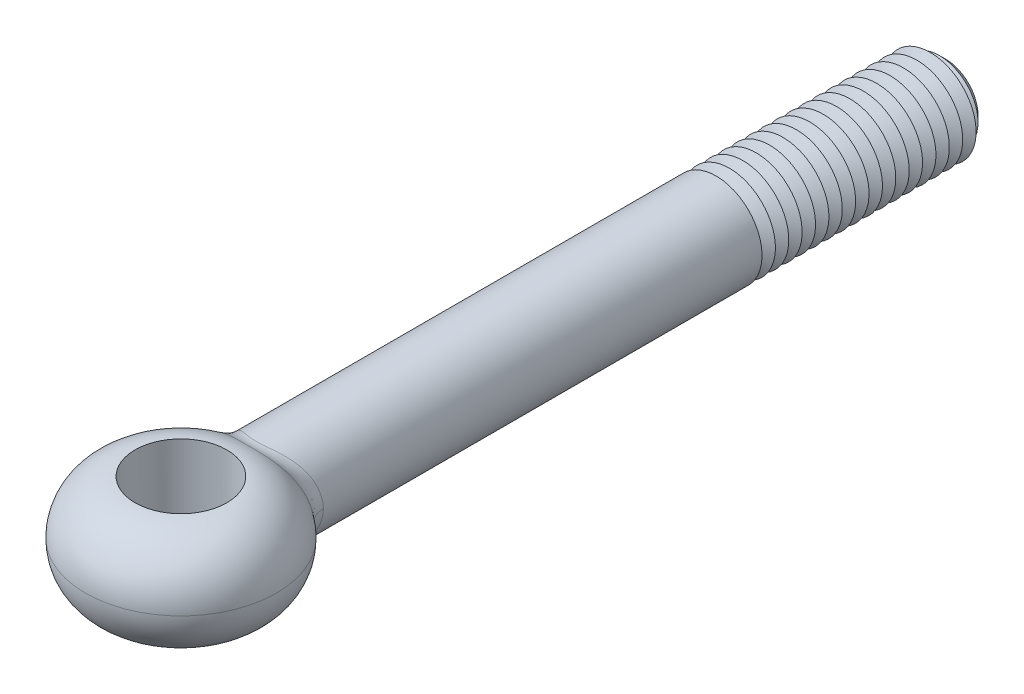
ISO-10303-21;
HEADER;
FILE_DESCRIPTION(('STEP AP214'),'2;1');
FILE_NAME('part.step','',(''),(''),'','','');
FILE_SCHEMA(('AUTOMOTIVE_DESIGN { 1 0 10303 214 1 1 1 1 }'));
ENDSEC;
DATA;
#1=APPLICATION_CONTEXT('core data for automotive mechanical design processes');
#2=APPLICATION_PROTOCOL_DEFINITION('international standard','automotive_design',2000,#1);
#3=PRODUCT_CONTEXT('',#1,'mechanical');
#4=PRODUCT('Part','Part','',(#3));
#5=PRODUCT_RELATED_PRODUCT_CATEGORY('part','',(#4));
#6=PRODUCT_DEFINITION_FORMATION('','',#4);
#7=PRODUCT_DEFINITION_CONTEXT('part definition',#1,'design');
#8=PRODUCT_DEFINITION('design','',#6,#7);
#9=PRODUCT_DEFINITION_SHAPE('','',#8);
#10=(LENGTH_UNIT() NAMED_UNIT(*) SI_UNIT(.MILLI.,.METRE.));
#11=(NAMED_UNIT(*) PLANE_ANGLE_UNIT() SI_UNIT($,.RADIAN.));
#12=(NAMED_UNIT(*) SI_UNIT($,.STERADIAN.) SOLID_ANGLE_UNIT());
#13=UNCERTAINTY_MEASURE_WITH_UNIT(LENGTH_MEASURE(1.E-05),#10,'distance_accuracy_value','');
#14=(GEOMETRIC_REPRESENTATION_CONTEXT(3) GLOBAL_UNCERTAINTY_ASSIGNED_CONTEXT((#13)) GLOBAL_UNIT_ASSIGNED_CONTEXT((#10,
#11,#12)) REPRESENTATION_CONTEXT('',''));
#15=CARTESIAN_POINT('',(0.,0.,0.));
#16=DIRECTION('',(0.,0.,1.));
#17=DIRECTION('',(1.,0.,0.));
#18=AXIS2_PLACEMENT_3D('',#15,#16,#17);
#19=CARTESIAN_POINT('',(0.,0.,-100.));
#20=DIRECTION('',(0.,0.,1.));
#21=DIRECTION('',(1.,0.,0.));
#22=AXIS2_PLACEMENT_3D('',#19,#20,#21);
#23=CYLINDRICAL_SURFACE('',#22,6.);
#24=CARTESIAN_POINT('',(0.,0.,-70.));
#25=DIRECTION('',(0.,0.,-1.));
#26=DIRECTION('',(-1.,0.,0.));
#27=AXIS2_PLACEMENT_3D('',#24,#25,#26);
#28=CIRCLE('',#27,6.);
#29=CARTESIAN_POINT('',(-6.,0.,-70.));
#30=VERTEX_POINT('',#29);
#31=EDGE_CURVE('E79',#30,#30,#28,.T.);
#32=ORIENTED_EDGE('',*,*,#31,.F.);
#33=EDGE_LOOP('',(#32));
#34=FACE_BOUND('',#33,.T.);
#35=CARTESIAN_POINT('',(5.9347688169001,-3.72936552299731,-9.76127797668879));
#36=CARTESIAN_POINT('',(5.01568840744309,-3.30684503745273,-10.6313747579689));
#37=CARTESIAN_POINT('',(4.83579180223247,-3.55177668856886,-11.9305846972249));
#38=CARTESIAN_POINT('',(6.04219931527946,-3.59564214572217,-9.79450956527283));
#39=CARTESIAN_POINT('',(5.09919553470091,-3.1795874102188,-10.6682119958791));
#40=CARTESIAN_POINT('',(4.92935060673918,-3.42442109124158,-11.9860495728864));
#41=CARTESIAN_POINT('',(6.1438473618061,-3.45763550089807,-9.82611020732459));
#42=CARTESIAN_POINT('',(5.17725322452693,-3.05002694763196,-10.702840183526));
#43=CARTESIAN_POINT('',(5.01812074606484,-3.29298619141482,-12.0386936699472));
#44=CARTESIAN_POINT('',(6.33498015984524,-3.17385997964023,-9.8857417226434));
#45=CARTESIAN_POINT('',(5.32290004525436,-2.78639390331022,-10.7677279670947));
#46=CARTESIAN_POINT('',(5.1853986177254,-3.02272379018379,-12.1378881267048));
#47=CARTESIAN_POINT('',(6.42446179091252,-3.02808912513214,-9.91377167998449));
#48=CARTESIAN_POINT('',(5.39041764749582,-2.65235488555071,-10.7979569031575));
#49=CARTESIAN_POINT('',(5.26390371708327,-2.88389440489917,-12.1844369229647));
#50=CARTESIAN_POINT('',(6.59063414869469,-2.72961135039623,-9.96594490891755));
#51=CARTESIAN_POINT('',(5.51491014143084,-2.38053035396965,-10.8538721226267));
#52=CARTESIAN_POINT('',(5.40994102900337,-2.5996298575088,-12.270973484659));
#53=CARTESIAN_POINT('',(6.66732079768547,-2.57690223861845,-9.99008694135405));
#54=CARTESIAN_POINT('',(5.57181683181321,-2.24279354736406,-10.8795284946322));
#55=CARTESIAN_POINT('',(5.47746974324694,-2.45419260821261,-12.3109591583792));
#56=CARTESIAN_POINT('',(6.80727548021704,-2.26566063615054,-10.0342164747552));
#57=CARTESIAN_POINT('',(5.67502497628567,-1.96438787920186,-10.9261769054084));
#58=CARTESIAN_POINT('',(5.60087770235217,-2.1577720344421,-12.3839763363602));
#59=CARTESIAN_POINT('',(6.87054514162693,-2.10712885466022,-10.0542044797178));
#60=CARTESIAN_POINT('',(5.72126980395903,-1.82378259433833,-10.9471437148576));
#61=CARTESIAN_POINT('',(5.65675836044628,-2.00678938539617,-12.4170086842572));
#62=CARTESIAN_POINT('',(7.03602672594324,-1.63406973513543,-10.1065323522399));
#63=CARTESIAN_POINT('',(5.84177866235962,-1.4066595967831,-11.0018788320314));
#64=CARTESIAN_POINT('',(5.80305576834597,-1.55625689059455,-12.5034220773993));
#65=CARTESIAN_POINT('',(7.11911563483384,-1.31267241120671,-10.1328771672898));
#66=CARTESIAN_POINT('',(5.90112324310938,-1.12766751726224,-11.0289752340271));
#67=CARTESIAN_POINT('',(5.87671572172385,-1.2501642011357,-12.5468355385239));
#68=CARTESIAN_POINT('',(7.23011866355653,-0.660856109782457,-10.1680856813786));
#69=CARTESIAN_POINT('',(5.98031743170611,-0.565466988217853,-11.0651706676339));
#70=CARTESIAN_POINT('',(5.97517391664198,-0.629386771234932,-12.6048310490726));
#71=CARTESIAN_POINT('',(7.25807152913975,-0.33044363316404,-10.1769616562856));
#72=CARTESIAN_POINT('',(6.00000388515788,-0.282923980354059,-11.0741952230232));
#73=CARTESIAN_POINT('',(6.0000064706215,-0.314708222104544,-12.6194333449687));
#74=CARTESIAN_POINT('',(7.25805738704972,0.335912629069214,-10.1769567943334));
#75=CARTESIAN_POINT('',(5.99999605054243,0.287606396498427,-11.0741911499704));
#76=CARTESIAN_POINT('',(5.99999342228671,0.319916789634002,-12.6194255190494));
#77=CARTESIAN_POINT('',(7.22915722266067,0.671857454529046,-10.1677796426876));
#78=CARTESIAN_POINT('',(5.97964504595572,0.574876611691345,-11.0648614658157));
#79=CARTESIAN_POINT('',(5.97431882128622,0.63986424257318,-12.6043279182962));
#80=CARTESIAN_POINT('',(7.11452740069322,1.33399050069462,-10.131423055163));
#81=CARTESIAN_POINT('',(5.89784251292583,1.14610230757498,-11.0274778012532));
#82=CARTESIAN_POINT('',(5.87264847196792,1.2704671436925,-12.5444393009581));
#83=CARTESIAN_POINT('',(7.02877559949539,1.66017486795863,-10.1042366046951));
#84=CARTESIAN_POINT('',(5.83657851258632,1.42936262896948,-10.9995093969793));
#85=CARTESIAN_POINT('',(5.79663311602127,1.58111892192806,-12.4996367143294));
#86=CARTESIAN_POINT('',(6.80343893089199,2.2930418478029,-10.0329875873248));
#87=CARTESIAN_POINT('',(5.67253761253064,1.98731296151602,-10.9250177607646));
#88=CARTESIAN_POINT('',(5.59744490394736,2.1838493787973,-12.3819651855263));
#89=CARTESIAN_POINT('',(6.66393326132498,2.59975238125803,-9.98894984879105));
#90=CARTESIAN_POINT('',(5.57019974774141,2.2614449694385,-10.8786920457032));
#91=CARTESIAN_POINT('',(5.47434142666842,2.47595464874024,-12.3091375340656));
#92=CARTESIAN_POINT('',(6.33535121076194,3.18625883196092,-9.88580293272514));
#93=CARTESIAN_POINT('',(5.32389744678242,2.79589244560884,-10.768093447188));
#94=CARTESIAN_POINT('',(5.18560859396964,3.03453222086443,-12.1380393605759));
#95=CARTESIAN_POINT('',(6.14627999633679,3.4660575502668,-9.82669532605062));
#96=CARTESIAN_POINT('',(5.18043230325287,3.05583228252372,-10.7040397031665));
#97=CARTESIAN_POINT('',(5.01998367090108,3.30100719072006,-12.0397714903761));
#98=CARTESIAN_POINT('',(5.7172577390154,4.00014270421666,-9.69400494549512));
#99=CARTESIAN_POINT('',(4.84766875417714,3.56284891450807,-10.5572649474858));
#100=CARTESIAN_POINT('',(4.64637499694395,3.8096597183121,-11.8183006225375));
#101=CARTESIAN_POINT('',(5.47601553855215,4.2534802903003,-9.62005911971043));
#102=CARTESIAN_POINT('',(4.65772328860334,3.80925143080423,-10.4742896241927));
#103=CARTESIAN_POINT('',(4.43732293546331,4.05093360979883,-11.694469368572));
#104=CARTESIAN_POINT('',(5.08259146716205,4.60342640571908,-9.50208552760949));
#105=CARTESIAN_POINT('',(4.34080391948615,4.15825147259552,-10.3388173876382));
#106=CARTESIAN_POINT('',(4.09924731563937,4.38421562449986,-11.4959320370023));
#107=CARTESIAN_POINT('',(4.9460782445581,4.71513594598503,-9.46155286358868));
#108=CARTESIAN_POINT('',(4.23020168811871,4.27084293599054,-10.2919789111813));
#109=CARTESIAN_POINT('',(3.98237779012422,4.49060566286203,-11.4275663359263));
#110=CARTESIAN_POINT('',(4.66296513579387,4.92813376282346,-9.37875537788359));
#111=CARTESIAN_POINT('',(3.99884628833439,4.48804462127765,-10.1953948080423));
#112=CARTESIAN_POINT('',(3.74115278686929,4.6934607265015,-11.2875507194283));
#113=CARTESIAN_POINT('',(4.5163679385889,5.0294247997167,-9.33649101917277));
#114=CARTESIAN_POINT('',(3.87815279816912,4.5926858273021,-10.1456674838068));
#115=CARTESIAN_POINT('',(3.61679930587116,4.78992838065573,-11.2159016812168));
#116=CARTESIAN_POINT('',(4.20225124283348,5.22831182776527,-9.24781094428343));
#117=CARTESIAN_POINT('',(3.61758964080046,4.80051594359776,-10.0403893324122));
#118=CARTESIAN_POINT('',(3.35180476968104,4.97934459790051,-11.0651470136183));
#119=CARTESIAN_POINT('',(4.03398632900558,5.3250780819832,-9.20131965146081));
#120=CARTESIAN_POINT('',(3.47696557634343,4.90311397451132,-9.98467073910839));
#121=CARTESIAN_POINT('',(3.21063957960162,5.07150293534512,-10.9858822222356));
#122=CARTESIAN_POINT('',(3.68652352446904,5.50578905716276,-9.10838168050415));
#123=CARTESIAN_POINT('',(3.18454628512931,5.09703954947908,-9.87225560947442));
#124=CARTESIAN_POINT('',(2.92111983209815,5.24360862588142,-10.8269291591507));
#125=CARTESIAN_POINT('',(3.50732357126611,5.5897313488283,-9.06193501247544));
#126=CARTESIAN_POINT('',(3.03278104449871,5.18843564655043,-9.81555489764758));
#127=CARTESIAN_POINT('',(2.77276391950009,5.32355366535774,-10.7472408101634));
#128=CARTESIAN_POINT('',(3.13794087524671,5.74446425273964,-8.97062224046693));
#129=CARTESIAN_POINT('',(2.71821702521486,5.35884982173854,-9.70314483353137));
#130=CARTESIAN_POINT('',(2.46931336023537,5.47091833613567,-10.5900722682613));
#131=CARTESIAN_POINT('',(2.94775184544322,5.81524723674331,-8.92575706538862));
#132=CARTESIAN_POINT('',(2.55541416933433,5.43794512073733,-9.64741385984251));
#133=CARTESIAN_POINT('',(2.31421486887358,5.53833070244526,-10.5125933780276));
#134=CARTESIAN_POINT('',(2.55657851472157,5.9431564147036,-8.83975050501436));
#135=CARTESIAN_POINT('',(2.21925064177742,5.58238081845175,-9.53980556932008));
#136=CARTESIAN_POINT('',(1.99786735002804,5.66014896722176,-10.3636052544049));
#137=CARTESIAN_POINT('',(2.35559801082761,6.00028737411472,-8.79860782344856));
#138=CARTESIAN_POINT('',(2.04585622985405,5.64781946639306,-9.48788433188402));
#139=CARTESIAN_POINT('',(1.83662049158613,5.71455940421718,-10.2920939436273));
#140=CARTESIAN_POINT('',(1.85774191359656,6.12093796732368,-8.70719486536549));
#141=CARTESIAN_POINT('',(1.61559271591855,5.78713197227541,-9.37194513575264));
#142=CARTESIAN_POINT('',(1.4406271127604,5.82946473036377,-10.1327613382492));
#143=CARTESIAN_POINT('',(1.55532271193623,6.17747996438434,-8.6600942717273));
#144=CARTESIAN_POINT('',(1.3529723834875,5.8538439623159,-9.31142342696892));
#145=CARTESIAN_POINT('',(1.20284157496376,5.88331425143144,-10.0502669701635));
#146=CARTESIAN_POINT('',(1.0891409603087,6.23930337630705,-8.60649289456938));
#147=CARTESIAN_POINT('',(0.947579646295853,5.92726352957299,-9.242285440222));
#148=CARTESIAN_POINT('',(0.83982684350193,5.94219369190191,-9.95617208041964));
#149=CARTESIAN_POINT('',(0.931962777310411,6.25606948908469,-8.59147969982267));
#150=CARTESIAN_POINT('',(0.810874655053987,5.94729550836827,-9.22285403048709));
#151=CARTESIAN_POINT('',(0.718001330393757,5.95816141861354,-9.92977025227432));
#152=CARTESIAN_POINT('',(0.614462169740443,6.2817502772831,-8.56819097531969));
#153=CARTESIAN_POINT('',(0.534722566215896,5.97803723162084,-9.19268813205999));
#154=CARTESIAN_POINT('',(0.472694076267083,5.98261931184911,-9.88878715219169));
#155=CARTESIAN_POINT('',(0.454140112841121,6.29066586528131,-8.5599146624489));
#156=CARTESIAN_POINT('',(0.395193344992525,5.98876738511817,-9.18193414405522));
#157=CARTESIAN_POINT('',(0.349212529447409,5.9911103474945,-9.87420450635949));
#158=CARTESIAN_POINT('',(0.131049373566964,6.30047562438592,-8.55079683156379));
#159=CARTESIAN_POINT('',(0.114068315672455,6.00056854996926,-9.17009294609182));
#160=CARTESIAN_POINT('',(0.100687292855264,6.00045297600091,-9.85813795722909));
#161=CARTESIAN_POINT('',(-0.0317286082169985,6.30131187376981,-8.55000899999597));
#162=CARTESIAN_POINT('',(-0.0276309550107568,6.00157787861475,-9.16906745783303));
#163=CARTESIAN_POINT('',(-0.02436125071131,6.00124940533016,-9.85674863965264));
#164=CARTESIAN_POINT('',(-0.356412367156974,6.29479284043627,-8.55608280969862));
#165=CARTESIAN_POINT('',(-0.31015318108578,5.99373179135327,-9.1769575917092));
#166=CARTESIAN_POINT('',(-0.274003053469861,5.9950408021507,-9.86745275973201));
#167=CARTESIAN_POINT('',(-0.518318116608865,6.28743729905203,-8.56294469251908));
#168=CARTESIAN_POINT('',(-0.451073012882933,5.98487067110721,-9.18587895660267));
#169=CARTESIAN_POINT('',(-0.398596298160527,5.98803552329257,-9.87954662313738));
#170=CARTESIAN_POINT('',(-0.839832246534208,6.26466677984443,-8.583729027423));
#171=CARTESIAN_POINT('',(-0.730746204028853,5.95757663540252,-9.21281914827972));
#172=CARTESIAN_POINT('',(-0.646718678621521,5.96634931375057,-9.91613502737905));
#173=CARTESIAN_POINT('',(-0.999430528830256,6.24922351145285,-8.59767625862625));
#174=CARTESIAN_POINT('',(-0.869577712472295,5.93909230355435,-9.23088715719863));
#175=CARTESIAN_POINT('',(-0.770242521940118,5.95164143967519,-9.94067308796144));
#176=CARTESIAN_POINT('',(-1.31437481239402,6.21055073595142,-8.63153922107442));
#177=CARTESIAN_POINT('',(-1.14330359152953,5.89311724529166,-9.27458059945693));
#178=CARTESIAN_POINT('',(-1.01506554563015,5.91481022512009,-10.0001513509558));
#179=CARTESIAN_POINT('',(-1.46971907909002,6.18731810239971,-8.65145734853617));
#180=CARTESIAN_POINT('',(-1.27826760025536,5.86559591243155,-9.30023316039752));
#181=CARTESIAN_POINT('',(-1.13636381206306,5.89268390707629,-10.0350957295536));
#182=CARTESIAN_POINT('',(-1.82539603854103,6.12454062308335,-8.70327656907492));
#183=CARTESIAN_POINT('',(-1.58698911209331,5.79180104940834,-9.36667644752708));
#184=CARTESIAN_POINT('',(-1.41557604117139,5.83289583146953,-10.1258248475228));
#185=CARTESIAN_POINT('',(-2.02378988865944,6.08214516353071,-8.73696553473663));
#186=CARTESIAN_POINT('',(-1.75893471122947,5.74230420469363,-9.40969592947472));
#187=CARTESIAN_POINT('',(-1.57246341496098,5.79251920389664,-10.184686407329));
#188=CARTESIAN_POINT('',(-2.41092164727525,5.98480792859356,-8.80979727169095));
#189=CARTESIAN_POINT('',(-2.09355200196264,5.63009686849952,-9.50199744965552));
#190=CARTESIAN_POINT('',(-1.880970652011,5.69981707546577,-10.3115469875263));
#191=CARTESIAN_POINT('',(-2.5996560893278,5.92986168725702,-8.84894198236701));
#192=CARTESIAN_POINT('',(-2.25629041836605,5.56730096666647,-9.55133195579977));
#193=CARTESIAN_POINT('',(-2.03258861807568,5.64748732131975,-10.3795492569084));
#194=CARTESIAN_POINT('',(-2.96755778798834,5.80783248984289,-8.93044371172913));
#195=CARTESIAN_POINT('',(-2.57232712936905,5.42968443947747,-9.65322105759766));
#196=CARTESIAN_POINT('',(-2.33036981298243,5.53126903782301,-10.5206862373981));
#197=CARTESIAN_POINT('',(-3.14671697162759,5.74073949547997,-8.97280337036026));
#198=CARTESIAN_POINT('',(-2.72564626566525,5.35477585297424,-9.70581299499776));
#199=CARTESIAN_POINT('',(-2.47652840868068,5.46737094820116,-10.593825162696));
#200=CARTESIAN_POINT('',(-3.49533769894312,5.59480022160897,-9.05896053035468));
#201=CARTESIAN_POINT('',(-3.02253770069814,5.19403391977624,-9.81188119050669));
#202=CARTESIAN_POINT('',(-2.76291205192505,5.32838116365,-10.742122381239));
#203=CARTESIAN_POINT('',(-3.66480050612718,5.51595547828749,-9.10275784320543));
#204=CARTESIAN_POINT('',(-3.16610934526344,5.10813119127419,-9.86537600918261));
#205=CARTESIAN_POINT('',(-2.90313787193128,5.2532909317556,-10.8172804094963));
#206=CARTESIAN_POINT('',(-3.99928684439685,5.34409495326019,-9.19187849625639));
#207=CARTESIAN_POINT('',(-3.44784552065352,4.92340384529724,-9.97329692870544));
#208=CARTESIAN_POINT('',(-3.18162491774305,5.08961424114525,-10.9697608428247));
#209=CARTESIAN_POINT('',(-4.16399459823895,5.25070632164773,-9.23720580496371));
#210=CARTESIAN_POINT('',(-3.58564022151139,4.82420269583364,-10.027694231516));
#211=CARTESIAN_POINT('',(-3.31967954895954,5.00067268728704,-11.0470755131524));
#212=CARTESIAN_POINT('',(-4.48282170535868,5.05207061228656,-9.32687019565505));
#213=CARTESIAN_POINT('',(-3.85050097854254,4.61613017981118,-10.1343299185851));
#214=CARTESIAN_POINT('',(-3.58838451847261,4.8114958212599,-11.1995795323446));
#215=CARTESIAN_POINT('',(-4.63694077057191,4.94682321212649,-9.37120725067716));
#216=CARTESIAN_POINT('',(-3.97751767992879,4.50720729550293,-10.1865592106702));
#217=CARTESIAN_POINT('',(-3.71903465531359,4.71126020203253,-11.2747688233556));
#218=CARTESIAN_POINT('',(-4.93402321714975,4.72498798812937,-9.45797232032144));
#219=CARTESIAN_POINT('',(-4.22045615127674,4.28075328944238,-10.2878502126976));
#220=CARTESIAN_POINT('',(-3.97205735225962,4.49998856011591,-11.421526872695));
#221=CARTESIAN_POINT('',(-5.0769962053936,4.60841012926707,-9.50040196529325));
#222=CARTESIAN_POINT('',(-4.33632375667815,4.16319510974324,-10.3368953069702));
#223=CARTESIAN_POINT('',(-4.09443702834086,4.38896202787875,-11.4930987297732));
#224=CARTESIAN_POINT('',(-5.35139946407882,4.36431803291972,-9.58269705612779));
#225=CARTESIAN_POINT('',(-4.55686646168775,3.92030762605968,-10.4311837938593));
#226=CARTESIAN_POINT('',(-4.3302405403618,4.15649336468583,-11.6315929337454));
#227=CARTESIAN_POINT('',(-5.48282554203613,4.2367998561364,-9.62256156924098));
#228=CARTESIAN_POINT('',(-4.66146230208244,3.79496029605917,-10.476398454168));
#229=CARTESIAN_POINT('',(-4.44366112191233,4.03504748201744,-11.6985135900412));
#230=CARTESIAN_POINT('',(-5.73992249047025,3.96459248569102,-9.70111653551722));
#231=CARTESIAN_POINT('',(-4.86435688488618,3.53075699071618,-10.5647509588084));
#232=CARTESIAN_POINT('',(-4.66626199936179,3.77580236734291,-11.8301121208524));
#233=CARTESIAN_POINT('',(-5.86493730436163,3.81935492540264,-9.73963775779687));
#234=CARTESIAN_POINT('',(-4.96192595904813,3.39157605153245,-10.6076101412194));
#235=CARTESIAN_POINT('',(-4.77491394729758,3.6374808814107,-11.894491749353));
#236=CARTESIAN_POINT('',(-6.10049317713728,3.5184514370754,-9.81259595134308));
#237=CARTESIAN_POINT('',(-5.14414695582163,3.10685040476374,-10.6881097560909));
#238=CARTESIAN_POINT('',(-4.98021019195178,3.35090613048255,-12.0161983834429));
#239=CARTESIAN_POINT('',(-6.21103492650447,3.36278600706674,-9.84703311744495));
#240=CARTESIAN_POINT('',(-5.22870245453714,2.96133570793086,-10.7257098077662));
#241=CARTESIAN_POINT('',(-5.07685506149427,3.20265333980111,-12.0735257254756));
#242=CARTESIAN_POINT('',(-6.41684087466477,3.04200182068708,-9.91136789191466));
#243=CARTESIAN_POINT('',(-5.38481615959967,2.66492089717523,-10.7954268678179));
#244=CARTESIAN_POINT('',(-5.25718892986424,2.89714459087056,-12.1804567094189));
#245=CARTESIAN_POINT('',(-6.51209487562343,2.87687685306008,-9.941262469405));
#246=CARTESIAN_POINT('',(-5.45627120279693,2.51407150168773,-10.8274993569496));
#247=CARTESIAN_POINT('',(-5.34086927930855,2.73988271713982,-12.230055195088));
#248=CARTESIAN_POINT('',(-6.68634060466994,2.53862818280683,-9.99606907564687));
#249=CARTESIAN_POINT('',(-5.58600966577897,2.20820283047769,-10.8859198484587));
#250=CARTESIAN_POINT('',(-5.49420876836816,2.41774112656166,-12.3208709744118));
#251=CARTESIAN_POINT('',(-6.7653416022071,2.365509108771,-10.0209839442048));
#252=CARTESIAN_POINT('',(-5.64421437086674,2.05326176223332,-10.9122330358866));
#253=CARTESIAN_POINT('',(-5.56387589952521,2.25286581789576,-12.3620930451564));
#254=CARTESIAN_POINT('',(-6.90530331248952,2.01532499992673,-10.0651851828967));
#255=CARTESIAN_POINT('',(-5.7466982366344,1.74251049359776,-10.9586742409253));
#256=CARTESIAN_POINT('',(-5.68746016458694,1.91935714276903,-12.4351539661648));
#257=CARTESIAN_POINT('',(-6.96652294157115,1.83836168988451,-10.0845522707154));
#258=CARTESIAN_POINT('',(-5.79110883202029,1.58683531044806,-10.9788602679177));
#259=CARTESIAN_POINT('',(-5.74160317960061,1.75082065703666,-12.4671274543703));
#260=CARTESIAN_POINT('',(-7.07189656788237,1.47955191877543,-10.1179144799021));
#261=CARTESIAN_POINT('',(-5.86721134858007,1.27322299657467,-11.0135080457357));
#262=CARTESIAN_POINT('',(-5.83487815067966,1.40909706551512,-12.5221684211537));
#263=CARTESIAN_POINT('',(-7.11605858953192,1.29770779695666,-10.1319121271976));
#264=CARTESIAN_POINT('',(-5.89885329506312,1.11539297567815,-11.02794716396));
#265=CARTESIAN_POINT('',(-5.87401716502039,1.2359121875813,-12.5452400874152));
#266=CARTESIAN_POINT('',(-7.18688145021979,0.930719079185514,-10.1543694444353));
#267=CARTESIAN_POINT('',(-5.9494736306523,0.79823853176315,-11.0510690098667));
#268=CARTESIAN_POINT('',(-5.93681662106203,0.886399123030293,-12.5822406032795));
#269=CARTESIAN_POINT('',(-7.21355030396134,0.745576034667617,-10.1628316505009));
#270=CARTESIAN_POINT('',(-5.9684191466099,0.639031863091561,-11.0597367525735));
#271=CARTESIAN_POINT('',(-5.96048415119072,0.710072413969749,-12.5961736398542));
#272=CARTESIAN_POINT('',(-7.24914599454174,0.373651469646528,-10.1741279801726));
#273=CARTESIAN_POINT('',(-5.99369065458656,0.319847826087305,-11.0713030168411));
#274=CARTESIAN_POINT('',(-5.99208005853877,0.355858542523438,-12.6147701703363));
#275=CARTESIAN_POINT('',(-7.25807450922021,0.186870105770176,-10.1769626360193));
#276=CARTESIAN_POINT('',(-5.999998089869,0.159994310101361,-11.074193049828));
#277=CARTESIAN_POINT('',(-6.00000992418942,0.17797152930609,-12.6194345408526));
#278=CARTESIAN_POINT('',(-7.25804656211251,-0.335738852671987,-10.1769531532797));
#279=CARTESIAN_POINT('',(-6.0000034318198,-0.287452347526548,-11.0741934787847));
#280=CARTESIAN_POINT('',(-5.99998216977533,-0.31975128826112,-12.6194203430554));
#281=CARTESIAN_POINT('',(-7.22917576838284,-0.671764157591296,-10.1677860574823));
#282=CARTESIAN_POINT('',(-5.97966209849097,-0.574787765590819,-11.0648695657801));
#283=CARTESIAN_POINT('',(-5.97433528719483,-0.639775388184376,-12.6043385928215));
#284=CARTESIAN_POINT('',(-7.1145105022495,-1.33407428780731,-10.1314171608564));
#285=CARTESIAN_POINT('',(-5.8978267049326,-1.14618252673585,-11.0274702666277));
#286=CARTESIAN_POINT('',(-5.8726334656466,-1.27054694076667,-12.5444294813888));
#287=CARTESIAN_POINT('',(-7.02869303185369,-1.66035512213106,-10.1042080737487));
#288=CARTESIAN_POINT('',(-5.83651996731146,-1.42954497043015,-10.999480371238));
#289=CARTESIAN_POINT('',(-5.79655816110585,-1.58129059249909,-12.4995901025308));
#290=CARTESIAN_POINT('',(-6.85971870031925,-2.13500368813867,-10.0507838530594));
#291=CARTESIAN_POINT('',(-5.71335936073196,-1.84847480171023,-10.9435562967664));
#292=CARTESIAN_POINT('',(-5.64719485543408,-2.03333684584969,-12.411356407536));
#293=CARTESIAN_POINT('',(-6.79670689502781,-2.29072029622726,-10.0308806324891));
#294=CARTESIAN_POINT('',(-5.66726413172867,-1.98670630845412,-10.9226633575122));
#295=CARTESIAN_POINT('',(-5.59155053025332,-2.18163837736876,-12.3784603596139));
#296=CARTESIAN_POINT('',(-6.65771758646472,-2.59645969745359,-9.98706290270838));
#297=CARTESIAN_POINT('',(-5.56469443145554,-2.26041067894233,-10.8763159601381));
#298=CARTESIAN_POINT('',(-5.46901133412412,-2.47281875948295,-12.3059514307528));
#299=CARTESIAN_POINT('',(-6.58173903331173,-2.74648202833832,-9.96314806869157));
#300=CARTESIAN_POINT('',(-5.50827469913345,-2.395823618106,-10.8508858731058));
#301=CARTESIAN_POINT('',(-5.40211555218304,-2.61569716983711,-12.2663380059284));
#302=CARTESIAN_POINT('',(-6.41741234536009,-3.03976673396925,-9.91156293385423));
#303=CARTESIAN_POINT('',(-5.38510014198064,-2.6630812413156,-10.7955752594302));
#304=CARTESIAN_POINT('',(-5.25771751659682,-2.89501593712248,-12.180769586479));
#305=CARTESIAN_POINT('',(-6.32906900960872,-3.18303170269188,-9.88389409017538));
#306=CARTESIAN_POINT('',(-5.3184112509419,-2.79488018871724,-10.7657236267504));
#307=CARTESIAN_POINT('',(-5.18021937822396,-3.03145876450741,-12.1348170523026));
#308=CARTESIAN_POINT('',(-6.14060484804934,-3.46203414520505,-9.82510194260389));
#309=CARTESIAN_POINT('',(-5.17475790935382,-3.05416625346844,-10.7017329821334));
#310=CARTESIAN_POINT('',(-5.01528894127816,-3.29717537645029,-12.0370139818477));
#311=CARTESIAN_POINT('',(-6.0404865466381,-3.5977732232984,-9.79397937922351));
#312=CARTESIAN_POINT('',(-5.09786126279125,-3.18162147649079,-10.6676230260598));
#313=CARTESIAN_POINT('',(-4.92785877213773,-3.42645068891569,-11.9851647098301));
#314=CARTESIAN_POINT('',(-5.9347688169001,-3.72936552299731,-9.76127797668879));
#315=CARTESIAN_POINT('',(-5.01568840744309,-3.30684503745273,-10.6313747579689));
#316=CARTESIAN_POINT('',(-4.83579180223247,-3.55177668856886,-11.9305846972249));
#317=(BOUNDED_SURFACE() B_SPLINE_SURFACE(3,2,((#35,#36,#37),(#38,#39,#40),(#41,#42,#43),(#44,
#45,#46),(#47,#48,#49),(#50,#51,#52),(#53,#54,#55),(#56,#57,#58),(#59,#60,#61),(#62,#63,#64),
(#65,#66,#67),(#68,#69,#70),(#71,#72,#73),(#74,#75,#76),(#77,#78,#79),(#80,#81,#82),(#83,#84,
#85),(#86,#87,#88),(#89,#90,#91),(#92,#93,#94),(#95,#96,#97),(#98,#99,#100),(#101,#102,#103),
(#104,#105,#106),(#107,#108,#109),(#110,#111,#112),(#113,#114,#115),(#116,#117,#118),(#119,#120,
#121),(#122,#123,#124),(#125,#126,#127),(#128,#129,#130),(#131,#132,#133),(#134,#135,#136),
(#137,#138,#139),(#140,#141,#142),(#143,#144,#145),(#146,#147,#148),(#149,#150,#151),(#152,#153,
#154),(#155,#156,#157),(#158,#159,#160),(#161,#162,#163),(#164,#165,#166),(#167,#168,#169),
(#170,#171,#172),(#173,#174,#175),(#176,#177,#178),(#179,#180,#181),(#182,#183,#184),(#185,#186,
#187),(#188,#189,#190),(#191,#192,#193),(#194,#195,#196),(#197,#198,#199),(#200,#201,#202),
(#203,#204,#205),(#206,#207,#208),(#209,#210,#211),(#212,#213,#214),(#215,#216,#217),(#218,#219,
#220),(#221,#222,#223),(#224,#225,#226),(#227,#228,#229),(#230,#231,#232),(#233,#234,#235),
(#236,#237,#238),(#239,#240,#241),(#242,#243,#244),(#245,#246,#247),(#248,#249,#250),(#251,#252,
#253),(#254,#255,#256),(#257,#258,#259),(#260,#261,#262),(#263,#264,#265),(#266,#267,#268),
(#269,#270,#271),(#272,#273,#274),(#275,#276,#277),(#278,#279,#280),(#281,#282,#283),(#284,#285,
#286),(#287,#288,#289),(#290,#291,#292),(#293,#294,#295),(#296,#297,#298),(#299,#300,#301),
(#302,#303,#304),(#305,#306,#307),(#308,#309,#310),(#311,#312,#313),(#314,#315,#316)),
.UNSPECIFIED.,.F.,.F.,.F.) B_SPLINE_SURFACE_WITH_KNOTS((4,2,2,2,2,2,2,2,2,2,2,2,2,2,2,2,2,2,2,2,
2,2,2,2,2,2,2,2,2,2,2,2,2,2,2,2,2,2,2,2,2,2,2,2,2,2,4),(3,3),(0.,0.730157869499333,
1.46050265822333,2.19107976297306,2.92156817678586,4.33710286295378,5.75164245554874,
7.18959333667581,8.62810462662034,10.0645045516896,11.5007548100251,12.9777469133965,
13.7173286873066,14.4567140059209,15.2508784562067,16.0451931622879,16.8399668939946,
17.6344627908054,18.7545699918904,19.3125249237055,19.8704149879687,20.4323016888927,
20.9942061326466,21.5580893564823,22.1221991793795,22.8711633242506,23.6203943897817,
24.3702474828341,25.1200026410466,25.8937593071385,26.6675370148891,27.440640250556,
28.214023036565,29.0276778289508,29.8412937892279,30.6554502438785,31.4691410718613,
32.2703098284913,33.0711012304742,33.8715254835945,34.6718740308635,36.109814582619,
37.5483362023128,38.2672339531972,38.986189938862,39.7048676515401,40.4233915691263),(0.,1.),
.UNSPECIFIED.) GEOMETRIC_REPRESENTATION_ITEM() RATIONAL_B_SPLINE_SURFACE(((1.,0.913704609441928,
1.),(1.,0.911808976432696,1.),(1.,0.909987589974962,1.),(1.,0.906521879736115,1.),(1.,
0.904877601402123,1.),(1.,0.901795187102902,1.),(1.,0.900357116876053,1.),(1.,0.897712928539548,
1.),(1.,0.896506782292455,1.),(1.,0.893335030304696,1.),(1.,0.891717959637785,1.),(1.,
0.889551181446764,1.),(1.,0.889000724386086,1.),(1.,0.88900105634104,1.),(1.,0.889570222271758,
1.),(1.,0.891807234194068,1.),(1.,0.893475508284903,1.),(1.,0.897791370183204,1.),(1.,
0.900437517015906,1.),(1.,0.90652846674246,1.),(1.,0.909973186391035,1.),(1.,0.917541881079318,
1.),(1.,0.921682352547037,1.),(1.,0.928122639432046,1.),(1.,0.930309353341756,1.),(1.,
0.934718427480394,1.),(1.,0.936940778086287,1.),(1.,0.941540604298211,1.),(1.,0.943917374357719,
1.),(1.,0.948597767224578,1.),(1.,0.9509013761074,1.),(1.,0.955362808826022,1.),(1.,
0.957520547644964,1.),(1.,0.961598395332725,1.),(1.,0.963518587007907,1.),(1.,0.967731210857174,
1.),(1.,0.969853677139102,1.),(1.,0.972244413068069,1.),(1.,0.972908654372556,1.),(1.,
0.973935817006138,1.),(1.,0.97429877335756,1.),(1.,0.974698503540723,1.),(1.,0.974732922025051,
1.),(1.,0.974466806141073,1.),(1.,0.974166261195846,1.),(1.,0.973250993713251,1.),(1.,
0.972635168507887,1.),(1.,0.9711286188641,1.),(1.,0.970237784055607,1.),(1.,0.967898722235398,
1.),(1.,0.966363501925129,1.),(1.,0.962996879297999,1.),(1.,0.961165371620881,1.),(1.,
0.957295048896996,1.),(1.,0.955256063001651,1.),(1.,0.951046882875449,1.),(1.,0.948876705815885,
1.),(1.,0.944396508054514,1.),(1.,0.942084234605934,1.),(1.,0.937444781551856,1.),(1.,
0.935117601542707,1.),(1.,0.93050246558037,1.),(1.,0.928214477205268,1.),(1.,0.923722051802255,
1.),(1.,0.921517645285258,1.),(1.,0.917125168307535,1.),(1.,0.914943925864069,1.),(1.,
0.910769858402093,1.),(1.,0.90877702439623,1.),(1.,0.905020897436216,1.),(1.,0.903257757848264,
1.),(1.,0.900001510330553,1.),(1.,0.898508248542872,1.),(1.,0.895843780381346,1.),(1.,
0.894667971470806,1.),(1.,0.892634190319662,1.),(1.,0.891776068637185,1.),(1.,0.890395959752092,
1.),(1.,0.889873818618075,1.),(1.,0.889176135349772,1.),(1.,0.889000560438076,1.),(1.,
0.889001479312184,1.),(1.,0.889569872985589,1.),(1.,0.89180755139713,1.),(1.,0.893477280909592,
1.),(1.,0.896713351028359,1.),(1.,0.897913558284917,1.),(1.,0.900537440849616,1.),(1.,
0.901961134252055,1.),(1.,0.905007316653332,1.),(1.,0.906629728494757,1.),(1.,0.910045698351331,
1.),(1.,0.911839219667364,1.),(1.,0.913704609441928,1.))) REPRESENTATION_ITEM('') SURFACE());
#318=CARTESIAN_POINT('',(-4.83579180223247,-3.55177668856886,-11.9305846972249));
#319=CARTESIAN_POINT('',(-4.92785877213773,-3.42645068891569,-11.9851647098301));
#320=CARTESIAN_POINT('',(-5.01528894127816,-3.29717537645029,-12.0370139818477));
#321=CARTESIAN_POINT('',(-5.18021937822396,-3.03145876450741,-12.1348170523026));
#322=CARTESIAN_POINT('',(-5.25771751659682,-2.89501593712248,-12.180769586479));
#323=CARTESIAN_POINT('',(-5.40211555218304,-2.61569716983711,-12.2663380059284));
#324=CARTESIAN_POINT('',(-5.46901133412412,-2.47281875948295,-12.3059514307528));
#325=CARTESIAN_POINT('',(-5.59155053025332,-2.18163837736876,-12.3784603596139));
#326=CARTESIAN_POINT('',(-5.64719485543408,-2.03333684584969,-12.411356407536));
#327=CARTESIAN_POINT('',(-5.79655816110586,-1.5812905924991,-12.4995901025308));
#328=CARTESIAN_POINT('',(-5.8726334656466,-1.27054694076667,-12.5444294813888));
#329=CARTESIAN_POINT('',(-5.97433528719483,-0.639775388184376,-12.6043385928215));
#330=CARTESIAN_POINT('',(-5.99998216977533,-0.31975128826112,-12.6194203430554));
#331=CARTESIAN_POINT('',(-6.00000992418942,0.17797152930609,-12.6194345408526));
#332=CARTESIAN_POINT('',(-5.99208005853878,0.355858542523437,-12.6147701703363));
#333=CARTESIAN_POINT('',(-5.96048415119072,0.71007241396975,-12.5961736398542));
#334=CARTESIAN_POINT('',(-5.93681662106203,0.886399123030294,-12.5822406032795));
#335=CARTESIAN_POINT('',(-5.87401716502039,1.2359121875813,-12.5452400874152));
#336=CARTESIAN_POINT('',(-5.83487815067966,1.40909706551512,-12.5221684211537));
#337=CARTESIAN_POINT('',(-5.74160317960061,1.75082065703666,-12.4671274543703));
#338=CARTESIAN_POINT('',(-5.68746016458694,1.91935714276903,-12.4351539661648));
#339=CARTESIAN_POINT('',(-5.56387589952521,2.25286581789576,-12.3620930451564));
#340=CARTESIAN_POINT('',(-5.49420876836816,2.41774112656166,-12.3208709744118));
#341=CARTESIAN_POINT('',(-5.34086927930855,2.73988271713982,-12.230055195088));
#342=CARTESIAN_POINT('',(-5.25718892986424,2.89714459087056,-12.1804567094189));
#343=CARTESIAN_POINT('',(-5.07685506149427,3.20265333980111,-12.0735257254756));
#344=CARTESIAN_POINT('',(-4.98021019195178,3.35090613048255,-12.0161983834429));
#345=CARTESIAN_POINT('',(-4.77491394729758,3.6374808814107,-11.894491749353));
#346=CARTESIAN_POINT('',(-4.66626199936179,3.77580236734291,-11.8301121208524));
#347=CARTESIAN_POINT('',(-4.44366112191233,4.03504748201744,-11.6985135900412));
#348=CARTESIAN_POINT('',(-4.3302405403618,4.15649336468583,-11.6315929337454));
#349=CARTESIAN_POINT('',(-4.09443702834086,4.38896202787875,-11.4930987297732));
#350=CARTESIAN_POINT('',(-3.97205735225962,4.49998856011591,-11.421526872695));
#351=CARTESIAN_POINT('',(-3.71903465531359,4.71126020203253,-11.2747688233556));
#352=CARTESIAN_POINT('',(-3.58838451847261,4.8114958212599,-11.1995795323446));
#353=CARTESIAN_POINT('',(-3.31967954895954,5.00067268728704,-11.0470755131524));
#354=CARTESIAN_POINT('',(-3.18162491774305,5.08961424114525,-10.9697608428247));
#355=CARTESIAN_POINT('',(-2.90313787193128,5.2532909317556,-10.8172804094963));
#356=CARTESIAN_POINT('',(-2.76291205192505,5.32838116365,-10.742122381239));
#357=CARTESIAN_POINT('',(-2.47652840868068,5.46737094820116,-10.593825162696));
#358=CARTESIAN_POINT('',(-2.33036981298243,5.53126903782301,-10.5206862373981));
#359=CARTESIAN_POINT('',(-2.03258861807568,5.64748732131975,-10.3795492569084));
#360=CARTESIAN_POINT('',(-1.880970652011,5.69981707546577,-10.3115469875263));
#361=CARTESIAN_POINT('',(-1.57246341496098,5.79251920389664,-10.184686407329));
#362=CARTESIAN_POINT('',(-1.41557604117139,5.83289583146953,-10.1258248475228));
#363=CARTESIAN_POINT('',(-1.13636381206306,5.89268390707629,-10.0350957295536));
#364=CARTESIAN_POINT('',(-1.01506554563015,5.91481022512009,-10.0001513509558));
#365=CARTESIAN_POINT('',(-0.770242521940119,5.95164143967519,-9.94067308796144));
#366=CARTESIAN_POINT('',(-0.64671867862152,5.96634931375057,-9.91613502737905));
#367=CARTESIAN_POINT('',(-0.398596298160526,5.98803552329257,-9.87954662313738));
#368=CARTESIAN_POINT('',(-0.274003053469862,5.9950408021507,-9.86745275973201));
#369=CARTESIAN_POINT('',(-0.0243612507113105,6.00124940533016,-9.85674863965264));
#370=CARTESIAN_POINT('',(0.100687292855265,6.00045297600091,-9.85813795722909));
#371=CARTESIAN_POINT('',(0.34921252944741,5.9911103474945,-9.87420450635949));
#372=CARTESIAN_POINT('',(0.472694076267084,5.98261931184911,-9.88878715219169));
#373=CARTESIAN_POINT('',(0.718001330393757,5.95816141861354,-9.92977025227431));
#374=CARTESIAN_POINT('',(0.83982684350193,5.94219369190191,-9.95617208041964));
#375=CARTESIAN_POINT('',(1.20284157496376,5.88331425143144,-10.0502669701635));
#376=CARTESIAN_POINT('',(1.4406271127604,5.82946473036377,-10.1327613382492));
#377=CARTESIAN_POINT('',(1.83662049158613,5.71455940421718,-10.2920939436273));
#378=CARTESIAN_POINT('',(1.99786735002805,5.66014896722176,-10.3636052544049));
#379=CARTESIAN_POINT('',(2.31421486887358,5.53833070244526,-10.5125933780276));
#380=CARTESIAN_POINT('',(2.46931336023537,5.47091833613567,-10.5900722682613));
#381=CARTESIAN_POINT('',(2.77276391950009,5.32355366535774,-10.7472408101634));
#382=CARTESIAN_POINT('',(2.92111983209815,5.24360862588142,-10.8269291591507));
#383=CARTESIAN_POINT('',(3.21063957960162,5.07150293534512,-10.9858822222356));
#384=CARTESIAN_POINT('',(3.35180476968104,4.97934459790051,-11.0651470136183));
#385=CARTESIAN_POINT('',(3.61679930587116,4.78992838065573,-11.2159016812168));
#386=CARTESIAN_POINT('',(3.74115278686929,4.6934607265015,-11.2875507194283));
#387=CARTESIAN_POINT('',(3.98237779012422,4.49060566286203,-11.4275663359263));
#388=CARTESIAN_POINT('',(4.09924731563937,4.38421562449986,-11.4959320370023));
#389=CARTESIAN_POINT('',(4.43732293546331,4.05093360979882,-11.694469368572));
#390=CARTESIAN_POINT('',(4.64637499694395,3.8096597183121,-11.8183006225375));
#391=CARTESIAN_POINT('',(5.01998367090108,3.30100719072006,-12.0397714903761));
#392=CARTESIAN_POINT('',(5.18560859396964,3.03453222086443,-12.1380393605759));
#393=CARTESIAN_POINT('',(5.47434142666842,2.47595464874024,-12.3091375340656));
#394=CARTESIAN_POINT('',(5.59744490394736,2.1838493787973,-12.3819651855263));
#395=CARTESIAN_POINT('',(5.79663311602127,1.58111892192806,-12.4996367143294));
#396=CARTESIAN_POINT('',(5.87264847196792,1.2704671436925,-12.5444393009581));
#397=CARTESIAN_POINT('',(5.97431882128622,0.63986424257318,-12.6043279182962));
#398=CARTESIAN_POINT('',(5.99999342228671,0.319916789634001,-12.6194255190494));
#399=CARTESIAN_POINT('',(6.0000064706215,-0.314708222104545,-12.6194333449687));
#400=CARTESIAN_POINT('',(5.97517391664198,-0.629386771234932,-12.6048310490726));
#401=CARTESIAN_POINT('',(5.87671572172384,-1.2501642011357,-12.5468355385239));
#402=CARTESIAN_POINT('',(5.80305576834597,-1.55625689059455,-12.5034220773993));
#403=CARTESIAN_POINT('',(5.65675836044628,-2.00678938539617,-12.4170086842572));
#404=CARTESIAN_POINT('',(5.60087770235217,-2.1577720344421,-12.3839763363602));
#405=CARTESIAN_POINT('',(5.47746974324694,-2.45419260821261,-12.3109591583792));
#406=CARTESIAN_POINT('',(5.40994102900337,-2.5996298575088,-12.270973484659));
#407=CARTESIAN_POINT('',(5.26390371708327,-2.88389440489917,-12.1844369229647));
#408=CARTESIAN_POINT('',(5.1853986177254,-3.02272379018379,-12.1378881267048));
#409=CARTESIAN_POINT('',(5.01812074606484,-3.29298619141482,-12.0386936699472));
#410=CARTESIAN_POINT('',(4.92935060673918,-3.42442109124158,-11.9860495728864));
#411=CARTESIAN_POINT('',(4.83579180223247,-3.55177668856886,-11.9305846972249));
#412=B_SPLINE_CURVE_WITH_KNOTS('',3,(#318,#319,#320,#321,#322,#323,#324,#325,#326,#327,#328,
#329,#330,#331,#332,#333,#334,#335,#336,#337,#338,#339,#340,#341,#342,#343,#344,#345,#346,#347,
#348,#349,#350,#351,#352,#353,#354,#355,#356,#357,#358,#359,#360,#361,#362,#363,#364,#365,#366,
#367,#368,#369,#370,#371,#372,#373,#374,#375,#376,#377,#378,#379,#380,#381,#382,#383,#384,#385,
#386,#387,#388,#389,#390,#391,#392,#393,#394,#395,#396,#397,#398,#399,#400,#401,#402,#403,#404,
#405,#406,#407,#408,#409,#410,#411),.UNSPECIFIED.,.F.,.F.,(4,2,2,2,2,2,2,2,2,2,2,2,2,2,2,2,2,2,
2,2,2,2,2,2,2,2,2,2,2,2,2,2,2,2,2,2,2,2,2,2,2,2,2,2,2,2,4),(0.,0.718523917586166,
1.43720163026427,2.15615761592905,2.87505536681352,4.31357698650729,5.7515175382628,
6.55186608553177,7.35229033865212,8.15308174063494,8.95425049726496,9.76794132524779,
10.5820977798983,11.3957137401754,12.2093685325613,12.9827513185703,13.7558545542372,
14.5296322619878,15.3033889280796,16.0531440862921,16.8029971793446,17.5522282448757,
18.3011923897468,18.865302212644,19.4291854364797,19.9910898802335,20.5529765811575,
21.1108666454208,21.6688215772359,22.7889287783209,23.5834246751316,24.3781984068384,
25.1725131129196,25.9666775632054,26.7060628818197,27.4456446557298,28.9226367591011,
30.3588870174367,31.7952869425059,33.2337982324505,34.6717491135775,36.0862887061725,
37.5018233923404,38.2323118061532,38.9628889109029,39.6932336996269,40.4233915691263),.UNSPECIFIED.);
#413=CARTESIAN_POINT('',(-6.,0.,-12.619429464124));
#414=VERTEX_POINT('',#413);
#415=CARTESIAN_POINT('',(6.,0.,-12.619429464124));
#416=VERTEX_POINT('',#415);
#417=EDGE_CURVE('E81',#414,#416,#412,.T.);
#418=ORIENTED_EDGE('',*,*,#417,.T.);
#419=CARTESIAN_POINT('',(-5.9347688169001,3.72936552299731,-9.76127797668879));
#420=CARTESIAN_POINT('',(-5.01568840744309,3.30684503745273,-10.6313747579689));
#421=CARTESIAN_POINT('',(-4.83579180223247,3.55177668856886,-11.9305846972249));
#422=CARTESIAN_POINT('',(-6.04219931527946,3.59564214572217,-9.79450956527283));
#423=CARTESIAN_POINT('',(-5.09919553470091,3.1795874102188,-10.6682119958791));
#424=CARTESIAN_POINT('',(-4.92935060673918,3.42442109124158,-11.9860495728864));
#425=CARTESIAN_POINT('',(-6.1438473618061,3.45763550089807,-9.82611020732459));
#426=CARTESIAN_POINT('',(-5.17725322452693,3.05002694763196,-10.702840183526));
#427=CARTESIAN_POINT('',(-5.01812074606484,3.29298619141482,-12.0386936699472));
#428=CARTESIAN_POINT('',(-6.33498015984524,3.17385997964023,-9.8857417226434));
#429=CARTESIAN_POINT('',(-5.32290004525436,2.78639390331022,-10.7677279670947));
#430=CARTESIAN_POINT('',(-5.1853986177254,3.02272379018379,-12.1378881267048));
#431=CARTESIAN_POINT('',(-6.42446179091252,3.02808912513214,-9.91377167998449));
#432=CARTESIAN_POINT('',(-5.39041764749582,2.65235488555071,-10.7979569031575));
#433=CARTESIAN_POINT('',(-5.26390371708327,2.88389440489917,-12.1844369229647));
#434=CARTESIAN_POINT('',(-6.59063414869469,2.72961135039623,-9.96594490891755));
#435=CARTESIAN_POINT('',(-5.51491014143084,2.38053035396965,-10.8538721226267));
#436=CARTESIAN_POINT('',(-5.40994102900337,2.5996298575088,-12.270973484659));
#437=CARTESIAN_POINT('',(-6.66732079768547,2.57690223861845,-9.99008694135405));
#438=CARTESIAN_POINT('',(-5.57181683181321,2.24279354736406,-10.8795284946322));
#439=CARTESIAN_POINT('',(-5.47746974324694,2.45419260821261,-12.3109591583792));
#440=CARTESIAN_POINT('',(-6.80727548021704,2.26566063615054,-10.0342164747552));
#441=CARTESIAN_POINT('',(-5.67502497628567,1.96438787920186,-10.9261769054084));
#442=CARTESIAN_POINT('',(-5.60087770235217,2.1577720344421,-12.3839763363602));
#443=CARTESIAN_POINT('',(-6.87054514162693,2.10712885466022,-10.0542044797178));
#444=CARTESIAN_POINT('',(-5.72126980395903,1.82378259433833,-10.9471437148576));
#445=CARTESIAN_POINT('',(-5.65675836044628,2.00678938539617,-12.4170086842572));
#446=CARTESIAN_POINT('',(-7.03602672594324,1.63406973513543,-10.1065323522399));
#447=CARTESIAN_POINT('',(-5.84177866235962,1.4066595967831,-11.0018788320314));
#448=CARTESIAN_POINT('',(-5.80305576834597,1.55625689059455,-12.5034220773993));
#449=CARTESIAN_POINT('',(-7.11911563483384,1.31267241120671,-10.1328771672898));
#450=CARTESIAN_POINT('',(-5.90112324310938,1.12766751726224,-11.0289752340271));
#451=CARTESIAN_POINT('',(-5.87671572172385,1.2501642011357,-12.5468355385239));
#452=CARTESIAN_POINT('',(-7.23011866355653,0.660856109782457,-10.1680856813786));
#453=CARTESIAN_POINT('',(-5.98031743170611,0.565466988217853,-11.0651706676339));
#454=CARTESIAN_POINT('',(-5.97517391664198,0.629386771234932,-12.6048310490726));
#455=CARTESIAN_POINT('',(-7.25807152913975,0.33044363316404,-10.1769616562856));
#456=CARTESIAN_POINT('',(-6.00000388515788,0.282923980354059,-11.0741952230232));
#457=CARTESIAN_POINT('',(-6.0000064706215,0.314708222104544,-12.6194333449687));
#458=CARTESIAN_POINT('',(-7.25805738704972,-0.335912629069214,-10.1769567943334));
#459=CARTESIAN_POINT('',(-5.99999605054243,-0.287606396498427,-11.0741911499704));
#460=CARTESIAN_POINT('',(-5.99999342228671,-0.319916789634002,-12.6194255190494));
#461=CARTESIAN_POINT('',(-7.22915722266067,-0.671857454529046,-10.1677796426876));
#462=CARTESIAN_POINT('',(-5.97964504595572,-0.574876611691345,-11.0648614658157));
#463=CARTESIAN_POINT('',(-5.97431882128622,-0.63986424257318,-12.6043279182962));
#464=CARTESIAN_POINT('',(-7.11452740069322,-1.33399050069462,-10.131423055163));
#465=CARTESIAN_POINT('',(-5.89784251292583,-1.14610230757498,-11.0274778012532));
#466=CARTESIAN_POINT('',(-5.87264847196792,-1.2704671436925,-12.5444393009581));
#467=CARTESIAN_POINT('',(-7.02877559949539,-1.66017486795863,-10.1042366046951));
#468=CARTESIAN_POINT('',(-5.83657851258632,-1.42936262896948,-10.9995093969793));
#469=CARTESIAN_POINT('',(-5.79663311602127,-1.58111892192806,-12.4996367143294));
#470=CARTESIAN_POINT('',(-6.80343893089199,-2.2930418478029,-10.0329875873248));
#471=CARTESIAN_POINT('',(-5.67253761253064,-1.98731296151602,-10.9250177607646));
#472=CARTESIAN_POINT('',(-5.59744490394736,-2.1838493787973,-12.3819651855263));
#473=CARTESIAN_POINT('',(-6.66393326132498,-2.59975238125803,-9.98894984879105));
#474=CARTESIAN_POINT('',(-5.57019974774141,-2.2614449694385,-10.8786920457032));
#475=CARTESIAN_POINT('',(-5.47434142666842,-2.47595464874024,-12.3091375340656));
#476=CARTESIAN_POINT('',(-6.33535121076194,-3.18625883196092,-9.88580293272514));
#477=CARTESIAN_POINT('',(-5.32389744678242,-2.79589244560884,-10.768093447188));
#478=CARTESIAN_POINT('',(-5.18560859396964,-3.03453222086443,-12.1380393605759));
#479=CARTESIAN_POINT('',(-6.14627999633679,-3.4660575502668,-9.82669532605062));
#480=CARTESIAN_POINT('',(-5.18043230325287,-3.05583228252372,-10.7040397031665));
#481=CARTESIAN_POINT('',(-5.01998367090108,-3.30100719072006,-12.0397714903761));
#482=CARTESIAN_POINT('',(-5.7172577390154,-4.00014270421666,-9.69400494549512));
#483=CARTESIAN_POINT('',(-4.84766875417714,-3.56284891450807,-10.5572649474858));
#484=CARTESIAN_POINT('',(-4.64637499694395,-3.8096597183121,-11.8183006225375));
#485=CARTESIAN_POINT('',(-5.47601553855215,-4.2534802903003,-9.62005911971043));
#486=CARTESIAN_POINT('',(-4.65772328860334,-3.80925143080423,-10.4742896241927));
#487=CARTESIAN_POINT('',(-4.43732293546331,-4.05093360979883,-11.694469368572));
#488=CARTESIAN_POINT('',(-5.08259146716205,-4.60342640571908,-9.50208552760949));
#489=CARTESIAN_POINT('',(-4.34080391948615,-4.15825147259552,-10.3388173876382));
#490=CARTESIAN_POINT('',(-4.09924731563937,-4.38421562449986,-11.4959320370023));
#491=CARTESIAN_POINT('',(-4.9460782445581,-4.71513594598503,-9.46155286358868));
#492=CARTESIAN_POINT('',(-4.23020168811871,-4.27084293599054,-10.2919789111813));
#493=CARTESIAN_POINT('',(-3.98237779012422,-4.49060566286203,-11.4275663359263));
#494=CARTESIAN_POINT('',(-4.66296513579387,-4.92813376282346,-9.37875537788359));
#495=CARTESIAN_POINT('',(-3.99884628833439,-4.48804462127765,-10.1953948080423));
#496=CARTESIAN_POINT('',(-3.74115278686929,-4.6934607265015,-11.2875507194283));
#497=CARTESIAN_POINT('',(-4.5163679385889,-5.0294247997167,-9.33649101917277));
#498=CARTESIAN_POINT('',(-3.87815279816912,-4.5926858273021,-10.1456674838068));
#499=CARTESIAN_POINT('',(-3.61679930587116,-4.78992838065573,-11.2159016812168));
#500=CARTESIAN_POINT('',(-4.20225124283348,-5.22831182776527,-9.24781094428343));
#501=CARTESIAN_POINT('',(-3.61758964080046,-4.80051594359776,-10.0403893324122));
#502=CARTESIAN_POINT('',(-3.35180476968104,-4.97934459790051,-11.0651470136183));
#503=CARTESIAN_POINT('',(-4.03398632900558,-5.3250780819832,-9.20131965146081));
#504=CARTESIAN_POINT('',(-3.47696557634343,-4.90311397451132,-9.98467073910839));
#505=CARTESIAN_POINT('',(-3.21063957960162,-5.07150293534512,-10.9858822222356));
#506=CARTESIAN_POINT('',(-3.68652352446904,-5.50578905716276,-9.10838168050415));
#507=CARTESIAN_POINT('',(-3.18454628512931,-5.09703954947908,-9.87225560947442));
#508=CARTESIAN_POINT('',(-2.92111983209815,-5.24360862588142,-10.8269291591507));
#509=CARTESIAN_POINT('',(-3.50732357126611,-5.5897313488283,-9.06193501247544));
#510=CARTESIAN_POINT('',(-3.03278104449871,-5.18843564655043,-9.81555489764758));
#511=CARTESIAN_POINT('',(-2.77276391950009,-5.32355366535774,-10.7472408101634));
#512=CARTESIAN_POINT('',(-3.13794087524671,-5.74446425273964,-8.97062224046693));
#513=CARTESIAN_POINT('',(-2.71821702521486,-5.35884982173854,-9.70314483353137));
#514=CARTESIAN_POINT('',(-2.46931336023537,-5.47091833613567,-10.5900722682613));
#515=CARTESIAN_POINT('',(-2.94775184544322,-5.81524723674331,-8.92575706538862));
#516=CARTESIAN_POINT('',(-2.55541416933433,-5.43794512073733,-9.64741385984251));
#517=CARTESIAN_POINT('',(-2.31421486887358,-5.53833070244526,-10.5125933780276));
#518=CARTESIAN_POINT('',(-2.55657851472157,-5.9431564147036,-8.83975050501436));
#519=CARTESIAN_POINT('',(-2.21925064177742,-5.58238081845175,-9.53980556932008));
#520=CARTESIAN_POINT('',(-1.99786735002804,-5.66014896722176,-10.3636052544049));
#521=CARTESIAN_POINT('',(-2.35559801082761,-6.00028737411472,-8.79860782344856));
#522=CARTESIAN_POINT('',(-2.04585622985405,-5.64781946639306,-9.48788433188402));
#523=CARTESIAN_POINT('',(-1.83662049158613,-5.71455940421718,-10.2920939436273));
#524=CARTESIAN_POINT('',(-1.85774191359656,-6.12093796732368,-8.70719486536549));
#525=CARTESIAN_POINT('',(-1.61559271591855,-5.78713197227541,-9.37194513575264));
#526=CARTESIAN_POINT('',(-1.4406271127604,-5.82946473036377,-10.1327613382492));
#527=CARTESIAN_POINT('',(-1.55532271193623,-6.17747996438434,-8.6600942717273));
#528=CARTESIAN_POINT('',(-1.3529723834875,-5.8538439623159,-9.31142342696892));
#529=CARTESIAN_POINT('',(-1.20284157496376,-5.88331425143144,-10.0502669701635));
#530=CARTESIAN_POINT('',(-1.0891409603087,-6.23930337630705,-8.60649289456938));
#531=CARTESIAN_POINT('',(-0.947579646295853,-5.92726352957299,-9.242285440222));
#532=CARTESIAN_POINT('',(-0.83982684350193,-5.94219369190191,-9.95617208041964));
#533=CARTESIAN_POINT('',(-0.931962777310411,-6.25606948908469,-8.59147969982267));
#534=CARTESIAN_POINT('',(-0.810874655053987,-5.94729550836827,-9.22285403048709));
#535=CARTESIAN_POINT('',(-0.718001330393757,-5.95816141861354,-9.92977025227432));
#536=CARTESIAN_POINT('',(-0.614462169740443,-6.2817502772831,-8.56819097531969));
#537=CARTESIAN_POINT('',(-0.534722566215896,-5.97803723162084,-9.19268813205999));
#538=CARTESIAN_POINT('',(-0.472694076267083,-5.98261931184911,-9.88878715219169));
#539=CARTESIAN_POINT('',(-0.454140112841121,-6.29066586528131,-8.5599146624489));
#540=CARTESIAN_POINT('',(-0.395193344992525,-5.98876738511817,-9.18193414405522));
#541=CARTESIAN_POINT('',(-0.349212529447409,-5.9911103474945,-9.87420450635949));
#542=CARTESIAN_POINT('',(-0.131049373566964,-6.30047562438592,-8.55079683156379));
#543=CARTESIAN_POINT('',(-0.114068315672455,-6.00056854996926,-9.17009294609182));
#544=CARTESIAN_POINT('',(-0.100687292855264,-6.00045297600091,-9.85813795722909));
#545=CARTESIAN_POINT('',(0.0317286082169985,-6.30131187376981,-8.55000899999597));
#546=CARTESIAN_POINT('',(0.0276309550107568,-6.00157787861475,-9.16906745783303));
#547=CARTESIAN_POINT('',(0.02436125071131,-6.00124940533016,-9.85674863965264));
#548=CARTESIAN_POINT('',(0.356412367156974,-6.29479284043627,-8.55608280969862));
#549=CARTESIAN_POINT('',(0.31015318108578,-5.99373179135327,-9.1769575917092));
#550=CARTESIAN_POINT('',(0.274003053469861,-5.9950408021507,-9.86745275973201));
#551=CARTESIAN_POINT('',(0.518318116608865,-6.28743729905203,-8.56294469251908));
#552=CARTESIAN_POINT('',(0.451073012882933,-5.98487067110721,-9.18587895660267));
#553=CARTESIAN_POINT('',(0.398596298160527,-5.98803552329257,-9.87954662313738));
#554=CARTESIAN_POINT('',(0.839832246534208,-6.26466677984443,-8.583729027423));
#555=CARTESIAN_POINT('',(0.730746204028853,-5.95757663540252,-9.21281914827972));
#556=CARTESIAN_POINT('',(0.646718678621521,-5.96634931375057,-9.91613502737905));
#557=CARTESIAN_POINT('',(0.999430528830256,-6.24922351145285,-8.59767625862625));
#558=CARTESIAN_POINT('',(0.869577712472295,-5.93909230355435,-9.23088715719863));
#559=CARTESIAN_POINT('',(0.770242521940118,-5.95164143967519,-9.94067308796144));
#560=CARTESIAN_POINT('',(1.31437481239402,-6.21055073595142,-8.63153922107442));
#561=CARTESIAN_POINT('',(1.14330359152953,-5.89311724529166,-9.27458059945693));
#562=CARTESIAN_POINT('',(1.01506554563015,-5.91481022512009,-10.0001513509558));
#563=CARTESIAN_POINT('',(1.46971907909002,-6.18731810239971,-8.65145734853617));
#564=CARTESIAN_POINT('',(1.27826760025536,-5.86559591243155,-9.30023316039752));
#565=CARTESIAN_POINT('',(1.13636381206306,-5.89268390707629,-10.0350957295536));
#566=CARTESIAN_POINT('',(1.82539603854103,-6.12454062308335,-8.70327656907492));
#567=CARTESIAN_POINT('',(1.58698911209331,-5.79180104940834,-9.36667644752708));
#568=CARTESIAN_POINT('',(1.41557604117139,-5.83289583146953,-10.1258248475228));
#569=CARTESIAN_POINT('',(2.02378988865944,-6.08214516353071,-8.73696553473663));
#570=CARTESIAN_POINT('',(1.75893471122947,-5.74230420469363,-9.40969592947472));
#571=CARTESIAN_POINT('',(1.57246341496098,-5.79251920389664,-10.184686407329));
#572=CARTESIAN_POINT('',(2.41092164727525,-5.98480792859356,-8.80979727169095));
#573=CARTESIAN_POINT('',(2.09355200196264,-5.63009686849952,-9.50199744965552));
#574=CARTESIAN_POINT('',(1.880970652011,-5.69981707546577,-10.3115469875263));
#575=CARTESIAN_POINT('',(2.5996560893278,-5.92986168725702,-8.84894198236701));
#576=CARTESIAN_POINT('',(2.25629041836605,-5.56730096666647,-9.55133195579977));
#577=CARTESIAN_POINT('',(2.03258861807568,-5.64748732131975,-10.3795492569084));
#578=CARTESIAN_POINT('',(2.96755778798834,-5.80783248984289,-8.93044371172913));
#579=CARTESIAN_POINT('',(2.57232712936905,-5.42968443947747,-9.65322105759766));
#580=CARTESIAN_POINT('',(2.33036981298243,-5.53126903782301,-10.5206862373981));
#581=CARTESIAN_POINT('',(3.14671697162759,-5.74073949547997,-8.97280337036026));
#582=CARTESIAN_POINT('',(2.72564626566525,-5.35477585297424,-9.70581299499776));
#583=CARTESIAN_POINT('',(2.47652840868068,-5.46737094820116,-10.593825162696));
#584=CARTESIAN_POINT('',(3.49533769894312,-5.59480022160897,-9.05896053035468));
#585=CARTESIAN_POINT('',(3.02253770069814,-5.19403391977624,-9.81188119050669));
#586=CARTESIAN_POINT('',(2.76291205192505,-5.32838116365,-10.742122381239));
#587=CARTESIAN_POINT('',(3.66480050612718,-5.51595547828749,-9.10275784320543));
#588=CARTESIAN_POINT('',(3.16610934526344,-5.10813119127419,-9.86537600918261));
#589=CARTESIAN_POINT('',(2.90313787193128,-5.2532909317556,-10.8172804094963));
#590=CARTESIAN_POINT('',(3.99928684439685,-5.34409495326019,-9.19187849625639));
#591=CARTESIAN_POINT('',(3.44784552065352,-4.92340384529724,-9.97329692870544));
#592=CARTESIAN_POINT('',(3.18162491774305,-5.08961424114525,-10.9697608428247));
#593=CARTESIAN_POINT('',(4.16399459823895,-5.25070632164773,-9.23720580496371));
#594=CARTESIAN_POINT('',(3.58564022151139,-4.82420269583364,-10.027694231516));
#595=CARTESIAN_POINT('',(3.31967954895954,-5.00067268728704,-11.0470755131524));
#596=CARTESIAN_POINT('',(4.48282170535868,-5.05207061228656,-9.32687019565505));
#597=CARTESIAN_POINT('',(3.85050097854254,-4.61613017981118,-10.1343299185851));
#598=CARTESIAN_POINT('',(3.58838451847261,-4.8114958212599,-11.1995795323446));
#599=CARTESIAN_POINT('',(4.63694077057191,-4.94682321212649,-9.37120725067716));
#600=CARTESIAN_POINT('',(3.97751767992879,-4.50720729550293,-10.1865592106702));
#601=CARTESIAN_POINT('',(3.71903465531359,-4.71126020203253,-11.2747688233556));
#602=CARTESIAN_POINT('',(4.93402321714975,-4.72498798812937,-9.45797232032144));
#603=CARTESIAN_POINT('',(4.22045615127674,-4.28075328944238,-10.2878502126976));
#604=CARTESIAN_POINT('',(3.97205735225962,-4.49998856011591,-11.421526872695));
#605=CARTESIAN_POINT('',(5.0769962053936,-4.60841012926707,-9.50040196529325));
#606=CARTESIAN_POINT('',(4.33632375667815,-4.16319510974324,-10.3368953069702));
#607=CARTESIAN_POINT('',(4.09443702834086,-4.38896202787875,-11.4930987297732));
#608=CARTESIAN_POINT('',(5.35139946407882,-4.36431803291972,-9.58269705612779));
#609=CARTESIAN_POINT('',(4.55686646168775,-3.92030762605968,-10.4311837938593));
#610=CARTESIAN_POINT('',(4.3302405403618,-4.15649336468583,-11.6315929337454));
#611=CARTESIAN_POINT('',(5.48282554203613,-4.2367998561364,-9.62256156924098));
#612=CARTESIAN_POINT('',(4.66146230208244,-3.79496029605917,-10.476398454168));
#613=CARTESIAN_POINT('',(4.44366112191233,-4.03504748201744,-11.6985135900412));
#614=CARTESIAN_POINT('',(5.73992249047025,-3.96459248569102,-9.70111653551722));
#615=CARTESIAN_POINT('',(4.86435688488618,-3.53075699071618,-10.5647509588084));
#616=CARTESIAN_POINT('',(4.66626199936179,-3.77580236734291,-11.8301121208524));
#617=CARTESIAN_POINT('',(5.86493730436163,-3.81935492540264,-9.73963775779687));
#618=CARTESIAN_POINT('',(4.96192595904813,-3.39157605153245,-10.6076101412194));
#619=CARTESIAN_POINT('',(4.77491394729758,-3.6374808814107,-11.894491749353));
#620=CARTESIAN_POINT('',(6.10049317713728,-3.5184514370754,-9.81259595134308));
#621=CARTESIAN_POINT('',(5.14414695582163,-3.10685040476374,-10.6881097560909));
#622=CARTESIAN_POINT('',(4.98021019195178,-3.35090613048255,-12.0161983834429));
#623=CARTESIAN_POINT('',(6.21103492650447,-3.36278600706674,-9.84703311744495));
#624=CARTESIAN_POINT('',(5.22870245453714,-2.96133570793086,-10.7257098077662));
#625=CARTESIAN_POINT('',(5.07685506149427,-3.20265333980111,-12.0735257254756));
#626=CARTESIAN_POINT('',(6.41684087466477,-3.04200182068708,-9.91136789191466));
#627=CARTESIAN_POINT('',(5.38481615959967,-2.66492089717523,-10.7954268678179));
#628=CARTESIAN_POINT('',(5.25718892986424,-2.89714459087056,-12.1804567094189));
#629=CARTESIAN_POINT('',(6.51209487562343,-2.87687685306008,-9.941262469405));
#630=CARTESIAN_POINT('',(5.45627120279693,-2.51407150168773,-10.8274993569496));
#631=CARTESIAN_POINT('',(5.34086927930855,-2.73988271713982,-12.230055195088));
#632=CARTESIAN_POINT('',(6.68634060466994,-2.53862818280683,-9.99606907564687));
#633=CARTESIAN_POINT('',(5.58600966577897,-2.20820283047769,-10.8859198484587));
#634=CARTESIAN_POINT('',(5.49420876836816,-2.41774112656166,-12.3208709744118));
#635=CARTESIAN_POINT('',(6.7653416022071,-2.365509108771,-10.0209839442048));
#636=CARTESIAN_POINT('',(5.64421437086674,-2.05326176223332,-10.9122330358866));
#637=CARTESIAN_POINT('',(5.56387589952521,-2.25286581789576,-12.3620930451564));
#638=CARTESIAN_POINT('',(6.90530331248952,-2.01532499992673,-10.0651851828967));
#639=CARTESIAN_POINT('',(5.7466982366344,-1.74251049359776,-10.9586742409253));
#640=CARTESIAN_POINT('',(5.68746016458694,-1.91935714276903,-12.4351539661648));
#641=CARTESIAN_POINT('',(6.96652294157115,-1.83836168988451,-10.0845522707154));
#642=CARTESIAN_POINT('',(5.79110883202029,-1.58683531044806,-10.9788602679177));
#643=CARTESIAN_POINT('',(5.74160317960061,-1.75082065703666,-12.4671274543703));
#644=CARTESIAN_POINT('',(7.07189656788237,-1.47955191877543,-10.1179144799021));
#645=CARTESIAN_POINT('',(5.86721134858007,-1.27322299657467,-11.0135080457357));
#646=CARTESIAN_POINT('',(5.83487815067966,-1.40909706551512,-12.5221684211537));
#647=CARTESIAN_POINT('',(7.11605858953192,-1.29770779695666,-10.1319121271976));
#648=CARTESIAN_POINT('',(5.89885329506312,-1.11539297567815,-11.02794716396));
#649=CARTESIAN_POINT('',(5.87401716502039,-1.2359121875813,-12.5452400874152));
#650=CARTESIAN_POINT('',(7.18688145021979,-0.930719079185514,-10.1543694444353));
#651=CARTESIAN_POINT('',(5.9494736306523,-0.79823853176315,-11.0510690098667));
#652=CARTESIAN_POINT('',(5.93681662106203,-0.886399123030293,-12.5822406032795));
#653=CARTESIAN_POINT('',(7.21355030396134,-0.745576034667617,-10.1628316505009));
#654=CARTESIAN_POINT('',(5.9684191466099,-0.639031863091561,-11.0597367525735));
#655=CARTESIAN_POINT('',(5.96048415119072,-0.710072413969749,-12.5961736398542));
#656=CARTESIAN_POINT('',(7.24914599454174,-0.373651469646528,-10.1741279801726));
#657=CARTESIAN_POINT('',(5.99369065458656,-0.319847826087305,-11.0713030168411));
#658=CARTESIAN_POINT('',(5.99208005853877,-0.355858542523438,-12.6147701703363));
#659=CARTESIAN_POINT('',(7.25807450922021,-0.186870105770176,-10.1769626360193));
#660=CARTESIAN_POINT('',(5.999998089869,-0.159994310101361,-11.074193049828));
#661=CARTESIAN_POINT('',(6.00000992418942,-0.17797152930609,-12.6194345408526));
#662=CARTESIAN_POINT('',(7.25804656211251,0.335738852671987,-10.1769531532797));
#663=CARTESIAN_POINT('',(6.0000034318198,0.287452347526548,-11.0741934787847));
#664=CARTESIAN_POINT('',(5.99998216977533,0.31975128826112,-12.6194203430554));
#665=CARTESIAN_POINT('',(7.22917576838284,0.671764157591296,-10.1677860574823));
#666=CARTESIAN_POINT('',(5.97966209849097,0.574787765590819,-11.0648695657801));
#667=CARTESIAN_POINT('',(5.97433528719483,0.639775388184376,-12.6043385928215));
#668=CARTESIAN_POINT('',(7.1145105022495,1.33407428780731,-10.1314171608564));
#669=CARTESIAN_POINT('',(5.8978267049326,1.14618252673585,-11.0274702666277));
#670=CARTESIAN_POINT('',(5.8726334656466,1.27054694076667,-12.5444294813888));
#671=CARTESIAN_POINT('',(7.02869303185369,1.66035512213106,-10.1042080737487));
#672=CARTESIAN_POINT('',(5.83651996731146,1.42954497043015,-10.999480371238));
#673=CARTESIAN_POINT('',(5.79655816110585,1.58129059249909,-12.4995901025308));
#674=CARTESIAN_POINT('',(6.85971870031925,2.13500368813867,-10.0507838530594));
#675=CARTESIAN_POINT('',(5.71335936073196,1.84847480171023,-10.9435562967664));
#676=CARTESIAN_POINT('',(5.64719485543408,2.03333684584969,-12.411356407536));
#677=CARTESIAN_POINT('',(6.79670689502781,2.29072029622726,-10.0308806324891));
#678=CARTESIAN_POINT('',(5.66726413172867,1.98670630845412,-10.9226633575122));
#679=CARTESIAN_POINT('',(5.59155053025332,2.18163837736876,-12.3784603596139));
#680=CARTESIAN_POINT('',(6.65771758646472,2.59645969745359,-9.98706290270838));
#681=CARTESIAN_POINT('',(5.56469443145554,2.26041067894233,-10.8763159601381));
#682=CARTESIAN_POINT('',(5.46901133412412,2.47281875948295,-12.3059514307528));
#683=CARTESIAN_POINT('',(6.58173903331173,2.74648202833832,-9.96314806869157));
#684=CARTESIAN_POINT('',(5.50827469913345,2.395823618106,-10.8508858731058));
#685=CARTESIAN_POINT('',(5.40211555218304,2.61569716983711,-12.2663380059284));
#686=CARTESIAN_POINT('',(6.41741234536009,3.03976673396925,-9.91156293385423));
#687=CARTESIAN_POINT('',(5.38510014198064,2.6630812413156,-10.7955752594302));
#688=CARTESIAN_POINT('',(5.25771751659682,2.89501593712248,-12.180769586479));
#689=CARTESIAN_POINT('',(6.32906900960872,3.18303170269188,-9.88389409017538));
#690=CARTESIAN_POINT('',(5.3184112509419,2.79488018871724,-10.7657236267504));
#691=CARTESIAN_POINT('',(5.18021937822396,3.03145876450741,-12.1348170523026));
#692=CARTESIAN_POINT('',(6.14060484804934,3.46203414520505,-9.82510194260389));
#693=CARTESIAN_POINT('',(5.17475790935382,3.05416625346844,-10.7017329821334));
#694=CARTESIAN_POINT('',(5.01528894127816,3.29717537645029,-12.0370139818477));
#695=CARTESIAN_POINT('',(6.0404865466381,3.5977732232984,-9.79397937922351));
#696=CARTESIAN_POINT('',(5.09786126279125,3.18162147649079,-10.6676230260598));
#697=CARTESIAN_POINT('',(4.92785877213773,3.42645068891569,-11.9851647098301));
#698=CARTESIAN_POINT('',(5.9347688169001,3.72936552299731,-9.76127797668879));
#699=CARTESIAN_POINT('',(5.01568840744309,3.30684503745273,-10.6313747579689));
#700=CARTESIAN_POINT('',(4.83579180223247,3.55177668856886,-11.9305846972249));
#701=(BOUNDED_SURFACE() B_SPLINE_SURFACE(3,2,((#419,#420,#421),(#422,#423,#424),(#425,#426,
#427),(#428,#429,#430),(#431,#432,#433),(#434,#435,#436),(#437,#438,#439),(#440,#441,#442),
(#443,#444,#445),(#446,#447,#448),(#449,#450,#451),(#452,#453,#454),(#455,#456,#457),(#458,#459,
#460),(#461,#462,#463),(#464,#465,#466),(#467,#468,#469),(#470,#471,#472),(#473,#474,#475),
(#476,#477,#478),(#479,#480,#481),(#482,#483,#484),(#485,#486,#487),(#488,#489,#490),(#491,#492,
#493),(#494,#495,#496),(#497,#498,#499),(#500,#501,#502),(#503,#504,#505),(#506,#507,#508),
(#509,#510,#511),(#512,#513,#514),(#515,#516,#517),(#518,#519,#520),(#521,#522,#523),(#524,#525,
#526),(#527,#528,#529),(#530,#531,#532),(#533,#534,#535),(#536,#537,#538),(#539,#540,#541),
(#542,#543,#544),(#545,#546,#547),(#548,#549,#550),(#551,#552,#553),(#554,#555,#556),(#557,#558,
#559),(#560,#561,#562),(#563,#564,#565),(#566,#567,#568),(#569,#570,#571),(#572,#573,#574),
(#575,#576,#577),(#578,#579,#580),(#581,#582,#583),(#584,#585,#586),(#587,#588,#589),(#590,#591,
#592),(#593,#594,#595),(#596,#597,#598),(#599,#600,#601),(#602,#603,#604),(#605,#606,#607),
(#608,#609,#610),(#611,#612,#613),(#614,#615,#616),(#617,#618,#619),(#620,#621,#622),(#623,#624,
#625),(#626,#627,#628),(#629,#630,#631),(#632,#633,#634),(#635,#636,#637),(#638,#639,#640),
(#641,#642,#643),(#644,#645,#646),(#647,#648,#649),(#650,#651,#652),(#653,#654,#655),(#656,#657,
#658),(#659,#660,#661),(#662,#663,#664),(#665,#666,#667),(#668,#669,#670),(#671,#672,#673),
(#674,#675,#676),(#677,#678,#679),(#680,#681,#682),(#683,#684,#685),(#686,#687,#688),(#689,#690,
#691),(#692,#693,#694),(#695,#696,#697),(#698,#699,#700)),.UNSPECIFIED.,.F.,.F.,
.F.) B_SPLINE_SURFACE_WITH_KNOTS((4,2,2,2,2,2,2,2,2,2,2,2,2,2,2,2,2,2,2,2,2,2,2,2,2,2,2,2,2,2,2,
2,2,2,2,2,2,2,2,2,2,2,2,2,2,2,4),(3,3),(0.,0.730157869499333,1.46050265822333,2.19107976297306,
2.92156817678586,4.33710286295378,5.75164245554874,7.18959333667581,8.62810462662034,
10.0645045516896,11.5007548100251,12.9777469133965,13.7173286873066,14.4567140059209,
15.2508784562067,16.0451931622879,16.8399668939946,17.6344627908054,18.7545699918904,
19.3125249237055,19.8704149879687,20.4323016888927,20.9942061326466,21.5580893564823,
22.1221991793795,22.8711633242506,23.6203943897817,24.3702474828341,25.1200026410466,
25.8937593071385,26.6675370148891,27.440640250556,28.214023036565,29.0276778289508,
29.8412937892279,30.6554502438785,31.4691410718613,32.2703098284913,33.0711012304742,
33.8715254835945,34.6718740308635,36.109814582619,37.5483362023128,38.2672339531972,
38.986189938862,39.7048676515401,40.4233915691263),(0.,1.),
.UNSPECIFIED.) GEOMETRIC_REPRESENTATION_ITEM() RATIONAL_B_SPLINE_SURFACE(((1.,0.913704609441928,
1.),(1.,0.911808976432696,1.),(1.,0.909987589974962,1.),(1.,0.906521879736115,1.),(1.,
0.904877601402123,1.),(1.,0.901795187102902,1.),(1.,0.900357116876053,1.),(1.,0.897712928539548,
1.),(1.,0.896506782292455,1.),(1.,0.893335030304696,1.),(1.,0.891717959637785,1.),(1.,
0.889551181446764,1.),(1.,0.889000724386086,1.),(1.,0.88900105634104,1.),(1.,0.889570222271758,
1.),(1.,0.891807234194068,1.),(1.,0.893475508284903,1.),(1.,0.897791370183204,1.),(1.,
0.900437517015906,1.),(1.,0.90652846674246,1.),(1.,0.909973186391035,1.),(1.,0.917541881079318,
1.),(1.,0.921682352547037,1.),(1.,0.928122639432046,1.),(1.,0.930309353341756,1.),(1.,
0.934718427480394,1.),(1.,0.936940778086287,1.),(1.,0.941540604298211,1.),(1.,0.943917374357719,
1.),(1.,0.948597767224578,1.),(1.,0.9509013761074,1.),(1.,0.955362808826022,1.),(1.,
0.957520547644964,1.),(1.,0.961598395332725,1.),(1.,0.963518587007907,1.),(1.,0.967731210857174,
1.),(1.,0.969853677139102,1.),(1.,0.972244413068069,1.),(1.,0.972908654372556,1.),(1.,
0.973935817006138,1.),(1.,0.97429877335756,1.),(1.,0.974698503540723,1.),(1.,0.974732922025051,
1.),(1.,0.974466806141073,1.),(1.,0.974166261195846,1.),(1.,0.973250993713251,1.),(1.,
0.972635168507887,1.),(1.,0.9711286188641,1.),(1.,0.970237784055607,1.),(1.,0.967898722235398,
1.),(1.,0.966363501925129,1.),(1.,0.962996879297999,1.),(1.,0.961165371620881,1.),(1.,
0.957295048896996,1.),(1.,0.955256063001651,1.),(1.,0.951046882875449,1.),(1.,0.948876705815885,
1.),(1.,0.944396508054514,1.),(1.,0.942084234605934,1.),(1.,0.937444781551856,1.),(1.,
0.935117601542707,1.),(1.,0.93050246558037,1.),(1.,0.928214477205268,1.),(1.,0.923722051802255,
1.),(1.,0.921517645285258,1.),(1.,0.917125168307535,1.),(1.,0.914943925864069,1.),(1.,
0.910769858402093,1.),(1.,0.90877702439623,1.),(1.,0.905020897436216,1.),(1.,0.903257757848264,
1.),(1.,0.900001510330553,1.),(1.,0.898508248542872,1.),(1.,0.895843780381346,1.),(1.,
0.894667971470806,1.),(1.,0.892634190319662,1.),(1.,0.891776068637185,1.),(1.,0.890395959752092,
1.),(1.,0.889873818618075,1.),(1.,0.889176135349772,1.),(1.,0.889000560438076,1.),(1.,
0.889001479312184,1.),(1.,0.889569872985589,1.),(1.,0.89180755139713,1.),(1.,0.893477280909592,
1.),(1.,0.896713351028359,1.),(1.,0.897913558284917,1.),(1.,0.900537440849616,1.),(1.,
0.901961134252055,1.),(1.,0.905007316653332,1.),(1.,0.906629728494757,1.),(1.,0.910045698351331,
1.),(1.,0.911839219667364,1.),(1.,0.913704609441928,1.))) REPRESENTATION_ITEM('') SURFACE());
#702=CARTESIAN_POINT('',(4.83579180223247,3.55177668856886,-11.9305846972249));
#703=CARTESIAN_POINT('',(4.92785877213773,3.42645068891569,-11.9851647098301));
#704=CARTESIAN_POINT('',(5.01528894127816,3.29717537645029,-12.0370139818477));
#705=CARTESIAN_POINT('',(5.18021937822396,3.03145876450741,-12.1348170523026));
#706=CARTESIAN_POINT('',(5.25771751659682,2.89501593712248,-12.180769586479));
#707=CARTESIAN_POINT('',(5.40211555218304,2.61569716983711,-12.2663380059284));
#708=CARTESIAN_POINT('',(5.46901133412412,2.47281875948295,-12.3059514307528));
#709=CARTESIAN_POINT('',(5.59155053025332,2.18163837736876,-12.3784603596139));
#710=CARTESIAN_POINT('',(5.64719485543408,2.03333684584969,-12.411356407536));
#711=CARTESIAN_POINT('',(5.79655816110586,1.5812905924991,-12.4995901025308));
#712=CARTESIAN_POINT('',(5.8726334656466,1.27054694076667,-12.5444294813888));
#713=CARTESIAN_POINT('',(5.97433528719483,0.639775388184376,-12.6043385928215));
#714=CARTESIAN_POINT('',(5.99998216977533,0.31975128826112,-12.6194203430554));
#715=CARTESIAN_POINT('',(6.00000992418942,-0.17797152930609,-12.6194345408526));
#716=CARTESIAN_POINT('',(5.99208005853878,-0.355858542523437,-12.6147701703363));
#717=CARTESIAN_POINT('',(5.96048415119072,-0.71007241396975,-12.5961736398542));
#718=CARTESIAN_POINT('',(5.93681662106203,-0.886399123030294,-12.5822406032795));
#719=CARTESIAN_POINT('',(5.87401716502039,-1.2359121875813,-12.5452400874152));
#720=CARTESIAN_POINT('',(5.83487815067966,-1.40909706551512,-12.5221684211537));
#721=CARTESIAN_POINT('',(5.74160317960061,-1.75082065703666,-12.4671274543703));
#722=CARTESIAN_POINT('',(5.68746016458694,-1.91935714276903,-12.4351539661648));
#723=CARTESIAN_POINT('',(5.56387589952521,-2.25286581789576,-12.3620930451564));
#724=CARTESIAN_POINT('',(5.49420876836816,-2.41774112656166,-12.3208709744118));
#725=CARTESIAN_POINT('',(5.34086927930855,-2.73988271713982,-12.230055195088));
#726=CARTESIAN_POINT('',(5.25718892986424,-2.89714459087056,-12.1804567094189));
#727=CARTESIAN_POINT('',(5.07685506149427,-3.20265333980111,-12.0735257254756));
#728=CARTESIAN_POINT('',(4.98021019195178,-3.35090613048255,-12.0161983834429));
#729=CARTESIAN_POINT('',(4.77491394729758,-3.6374808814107,-11.894491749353));
#730=CARTESIAN_POINT('',(4.66626199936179,-3.77580236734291,-11.8301121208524));
#731=CARTESIAN_POINT('',(4.44366112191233,-4.03504748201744,-11.6985135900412));
#732=CARTESIAN_POINT('',(4.3302405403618,-4.15649336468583,-11.6315929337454));
#733=CARTESIAN_POINT('',(4.09443702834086,-4.38896202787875,-11.4930987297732));
#734=CARTESIAN_POINT('',(3.97205735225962,-4.49998856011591,-11.421526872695));
#735=CARTESIAN_POINT('',(3.71903465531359,-4.71126020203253,-11.2747688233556));
#736=CARTESIAN_POINT('',(3.58838451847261,-4.8114958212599,-11.1995795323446));
#737=CARTESIAN_POINT('',(3.31967954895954,-5.00067268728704,-11.0470755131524));
#738=CARTESIAN_POINT('',(3.18162491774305,-5.08961424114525,-10.9697608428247));
#739=CARTESIAN_POINT('',(2.90313787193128,-5.2532909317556,-10.8172804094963));
#740=CARTESIAN_POINT('',(2.76291205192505,-5.32838116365,-10.742122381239));
#741=CARTESIAN_POINT('',(2.47652840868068,-5.46737094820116,-10.593825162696));
#742=CARTESIAN_POINT('',(2.33036981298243,-5.53126903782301,-10.5206862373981));
#743=CARTESIAN_POINT('',(2.03258861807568,-5.64748732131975,-10.3795492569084));
#744=CARTESIAN_POINT('',(1.880970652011,-5.69981707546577,-10.3115469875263));
#745=CARTESIAN_POINT('',(1.57246341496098,-5.79251920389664,-10.184686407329));
#746=CARTESIAN_POINT('',(1.41557604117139,-5.83289583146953,-10.1258248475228));
#747=CARTESIAN_POINT('',(1.13636381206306,-5.89268390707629,-10.0350957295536));
#748=CARTESIAN_POINT('',(1.01506554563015,-5.91481022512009,-10.0001513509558));
#749=CARTESIAN_POINT('',(0.770242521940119,-5.95164143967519,-9.94067308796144));
#750=CARTESIAN_POINT('',(0.64671867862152,-5.96634931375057,-9.91613502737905));
#751=CARTESIAN_POINT('',(0.398596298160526,-5.98803552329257,-9.87954662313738));
#752=CARTESIAN_POINT('',(0.274003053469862,-5.9950408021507,-9.86745275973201));
#753=CARTESIAN_POINT('',(0.0243612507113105,-6.00124940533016,-9.85674863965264));
#754=CARTESIAN_POINT('',(-0.100687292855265,-6.00045297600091,-9.85813795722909));
#755=CARTESIAN_POINT('',(-0.34921252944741,-5.9911103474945,-9.87420450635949));
#756=CARTESIAN_POINT('',(-0.472694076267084,-5.98261931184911,-9.88878715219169));
#757=CARTESIAN_POINT('',(-0.718001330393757,-5.95816141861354,-9.92977025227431));
#758=CARTESIAN_POINT('',(-0.83982684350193,-5.94219369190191,-9.95617208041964));
#759=CARTESIAN_POINT('',(-1.20284157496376,-5.88331425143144,-10.0502669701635));
#760=CARTESIAN_POINT('',(-1.4406271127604,-5.82946473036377,-10.1327613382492));
#761=CARTESIAN_POINT('',(-1.83662049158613,-5.71455940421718,-10.2920939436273));
#762=CARTESIAN_POINT('',(-1.99786735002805,-5.66014896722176,-10.3636052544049));
#763=CARTESIAN_POINT('',(-2.31421486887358,-5.53833070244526,-10.5125933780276));
#764=CARTESIAN_POINT('',(-2.46931336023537,-5.47091833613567,-10.5900722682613));
#765=CARTESIAN_POINT('',(-2.77276391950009,-5.32355366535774,-10.7472408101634));
#766=CARTESIAN_POINT('',(-2.92111983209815,-5.24360862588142,-10.8269291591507));
#767=CARTESIAN_POINT('',(-3.21063957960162,-5.07150293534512,-10.9858822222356));
#768=CARTESIAN_POINT('',(-3.35180476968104,-4.97934459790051,-11.0651470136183));
#769=CARTESIAN_POINT('',(-3.61679930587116,-4.78992838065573,-11.2159016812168));
#770=CARTESIAN_POINT('',(-3.74115278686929,-4.6934607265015,-11.2875507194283));
#771=CARTESIAN_POINT('',(-3.98237779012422,-4.49060566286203,-11.4275663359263));
#772=CARTESIAN_POINT('',(-4.09924731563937,-4.38421562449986,-11.4959320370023));
#773=CARTESIAN_POINT('',(-4.43732293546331,-4.05093360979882,-11.694469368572));
#774=CARTESIAN_POINT('',(-4.64637499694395,-3.8096597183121,-11.8183006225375));
#775=CARTESIAN_POINT('',(-5.01998367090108,-3.30100719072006,-12.0397714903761));
#776=CARTESIAN_POINT('',(-5.18560859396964,-3.03453222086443,-12.1380393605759));
#777=CARTESIAN_POINT('',(-5.47434142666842,-2.47595464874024,-12.3091375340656));
#778=CARTESIAN_POINT('',(-5.59744490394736,-2.1838493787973,-12.3819651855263));
#779=CARTESIAN_POINT('',(-5.79663311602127,-1.58111892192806,-12.4996367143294));
#780=CARTESIAN_POINT('',(-5.87264847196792,-1.2704671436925,-12.5444393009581));
#781=CARTESIAN_POINT('',(-5.97431882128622,-0.63986424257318,-12.6043279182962));
#782=CARTESIAN_POINT('',(-5.99999342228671,-0.319916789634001,-12.6194255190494));
#783=CARTESIAN_POINT('',(-6.0000064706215,0.314708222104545,-12.6194333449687));
#784=CARTESIAN_POINT('',(-5.97517391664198,0.629386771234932,-12.6048310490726));
#785=CARTESIAN_POINT('',(-5.87671572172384,1.2501642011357,-12.5468355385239));
#786=CARTESIAN_POINT('',(-5.80305576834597,1.55625689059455,-12.5034220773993));
#787=CARTESIAN_POINT('',(-5.65675836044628,2.00678938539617,-12.4170086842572));
#788=CARTESIAN_POINT('',(-5.60087770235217,2.1577720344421,-12.3839763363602));
#789=CARTESIAN_POINT('',(-5.47746974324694,2.45419260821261,-12.3109591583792));
#790=CARTESIAN_POINT('',(-5.40994102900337,2.5996298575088,-12.270973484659));
#791=CARTESIAN_POINT('',(-5.26390371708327,2.88389440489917,-12.1844369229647));
#792=CARTESIAN_POINT('',(-5.1853986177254,3.02272379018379,-12.1378881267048));
#793=CARTESIAN_POINT('',(-5.01812074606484,3.29298619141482,-12.0386936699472));
#794=CARTESIAN_POINT('',(-4.92935060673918,3.42442109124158,-11.9860495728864));
#795=CARTESIAN_POINT('',(-4.83579180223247,3.55177668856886,-11.9305846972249));
#796=B_SPLINE_CURVE_WITH_KNOTS('',3,(#702,#703,#704,#705,#706,#707,#708,#709,#710,#711,#712,
#713,#714,#715,#716,#717,#718,#719,#720,#721,#722,#723,#724,#725,#726,#727,#728,#729,#730,#731,
#732,#733,#734,#735,#736,#737,#738,#739,#740,#741,#742,#743,#744,#745,#746,#747,#748,#749,#750,
#751,#752,#753,#754,#755,#756,#757,#758,#759,#760,#761,#762,#763,#764,#765,#766,#767,#768,#769,
#770,#771,#772,#773,#774,#775,#776,#777,#778,#779,#780,#781,#782,#783,#784,#785,#786,#787,#788,
#789,#790,#791,#792,#793,#794,#795),.UNSPECIFIED.,.F.,.F.,(4,2,2,2,2,2,2,2,2,2,2,2,2,2,2,2,2,2,
2,2,2,2,2,2,2,2,2,2,2,2,2,2,2,2,2,2,2,2,2,2,2,2,2,2,2,2,4),(0.,0.718523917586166,
1.43720163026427,2.15615761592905,2.87505536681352,4.31357698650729,5.7515175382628,
6.55186608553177,7.35229033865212,8.15308174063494,8.95425049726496,9.76794132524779,
10.5820977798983,11.3957137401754,12.2093685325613,12.9827513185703,13.7558545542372,
14.5296322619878,15.3033889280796,16.0531440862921,16.8029971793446,17.5522282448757,
18.3011923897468,18.865302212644,19.4291854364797,19.9910898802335,20.5529765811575,
21.1108666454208,21.6688215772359,22.7889287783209,23.5834246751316,24.3781984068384,
25.1725131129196,25.9666775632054,26.7060628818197,27.4456446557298,28.9226367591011,
30.3588870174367,31.7952869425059,33.2337982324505,34.6717491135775,36.0862887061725,
37.5018233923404,38.2323118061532,38.9628889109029,39.6932336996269,40.4233915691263),.UNSPECIFIED.);
#797=EDGE_CURVE('E74',#416,#414,#796,.T.);
#798=ORIENTED_EDGE('',*,*,#797,.T.);
#799=EDGE_LOOP('',(#418,#798));
#800=FACE_BOUND('',#799,.T.);
#801=ADVANCED_FACE('F39',(#34,#800),#23,.T.);
#802=CARTESIAN_POINT('',(0.,0.,0.));
#803=DIRECTION('',(0.,1.,0.));
#804=DIRECTION('',(0.,0.,1.));
#805=AXIS2_PLACEMENT_3D('',#802,#803,#804);
#806=DEGENERATE_TOROIDAL_SURFACE('',#805,5.5,7.,.T.);
#807=CARTESIAN_POINT('',(0.,6.98212002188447,0.));
#808=DIRECTION('',(0.,-1.,0.));
#809=DIRECTION('',(0.,0.,-1.));
#810=AXIS2_PLACEMENT_3D('',#807,#808,#809);
#811=CIRCLE('',#810,6.);
#812=CARTESIAN_POINT('',(0.,6.98212002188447,-6.));
#813=VERTEX_POINT('',#812);
#814=EDGE_CURVE('E169',#813,#813,#811,.F.);
#815=ORIENTED_EDGE('',*,*,#814,.F.);
#816=EDGE_LOOP('',(#815));
#817=FACE_BOUND('',#816,.T.);
#818=CARTESIAN_POINT('',(0.,0.,0.));
#819=DIRECTION('',(0.,1.,0.));
#820=DIRECTION('',(0.,0.,1.));
#821=AXIS2_PLACEMENT_3D('',#818,#819,#820);
#822=CIRCLE('',#821,12.5);
#823=CARTESIAN_POINT('',(7.25806451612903,0.,-10.1769592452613));
#824=VERTEX_POINT('',#823);
#825=CARTESIAN_POINT('',(-7.25806451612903,0.,-10.1769592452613));
#826=VERTEX_POINT('',#825);
#827=EDGE_CURVE('E85',#824,#826,#822,.F.);
#828=ORIENTED_EDGE('',*,*,#827,.F.);
#829=CARTESIAN_POINT('',(5.9347688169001,-3.72936552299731,-9.76127797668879));
#830=CARTESIAN_POINT('',(6.04219931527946,-3.59564214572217,-9.79450956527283));
#831=CARTESIAN_POINT('',(6.1438473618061,-3.45763550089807,-9.82611020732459));
#832=CARTESIAN_POINT('',(6.33498015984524,-3.17385997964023,-9.8857417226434));
#833=CARTESIAN_POINT('',(6.42446179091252,-3.02808912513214,-9.91377167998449));
#834=CARTESIAN_POINT('',(6.59063414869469,-2.72961135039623,-9.96594490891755));
#835=CARTESIAN_POINT('',(6.66732079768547,-2.57690223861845,-9.99008694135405));
#836=CARTESIAN_POINT('',(6.80727548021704,-2.26566063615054,-10.0342164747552));
#837=CARTESIAN_POINT('',(6.87054514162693,-2.10712885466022,-10.0542044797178));
#838=CARTESIAN_POINT('',(7.03602672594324,-1.63406973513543,-10.1065323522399));
#839=CARTESIAN_POINT('',(7.11911563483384,-1.31267241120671,-10.1328771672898));
#840=CARTESIAN_POINT('',(7.23011866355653,-0.660856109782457,-10.1680856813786));
#841=CARTESIAN_POINT('',(7.25807152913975,-0.33044363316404,-10.1769616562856));
#842=CARTESIAN_POINT('',(7.25805738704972,0.335912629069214,-10.1769567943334));
#843=CARTESIAN_POINT('',(7.22915722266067,0.671857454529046,-10.1677796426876));
#844=CARTESIAN_POINT('',(7.11452740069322,1.33399050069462,-10.131423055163));
#845=CARTESIAN_POINT('',(7.02877559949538,1.66017486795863,-10.1042366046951));
#846=CARTESIAN_POINT('',(6.80343893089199,2.2930418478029,-10.0329875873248));
#847=CARTESIAN_POINT('',(6.66393326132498,2.59975238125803,-9.98894984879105));
#848=CARTESIAN_POINT('',(6.33535121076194,3.18625883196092,-9.88580293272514));
#849=CARTESIAN_POINT('',(6.14627999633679,3.4660575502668,-9.82669532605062));
#850=CARTESIAN_POINT('',(5.7172577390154,4.00014270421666,-9.69400494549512));
#851=CARTESIAN_POINT('',(5.47601553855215,4.2534802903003,-9.62005911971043));
#852=CARTESIAN_POINT('',(5.08259146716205,4.60342640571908,-9.50208552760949));
#853=CARTESIAN_POINT('',(4.9460782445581,4.71513594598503,-9.46155286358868));
#854=CARTESIAN_POINT('',(4.66296513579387,4.92813376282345,-9.37875537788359));
#855=CARTESIAN_POINT('',(4.5163679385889,5.0294247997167,-9.33649101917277));
#856=CARTESIAN_POINT('',(4.20225124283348,5.22831182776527,-9.24781094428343));
#857=CARTESIAN_POINT('',(4.03398632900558,5.3250780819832,-9.20131965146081));
#858=CARTESIAN_POINT('',(3.68652352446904,5.50578905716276,-9.10838168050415));
#859=CARTESIAN_POINT('',(3.50732357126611,5.5897313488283,-9.06193501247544));
#860=CARTESIAN_POINT('',(3.13794087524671,5.74446425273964,-8.97062224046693));
#861=CARTESIAN_POINT('',(2.94775184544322,5.81524723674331,-8.92575706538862));
#862=CARTESIAN_POINT('',(2.55657851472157,5.9431564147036,-8.83975050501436));
#863=CARTESIAN_POINT('',(2.35559801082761,6.00028737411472,-8.79860782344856));
#864=CARTESIAN_POINT('',(1.85774191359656,6.12093796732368,-8.70719486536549));
#865=CARTESIAN_POINT('',(1.55532271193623,6.17747996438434,-8.66009427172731));
#866=CARTESIAN_POINT('',(1.0891409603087,6.23930337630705,-8.60649289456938));
#867=CARTESIAN_POINT('',(0.931962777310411,6.25606948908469,-8.59147969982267));
#868=CARTESIAN_POINT('',(0.614462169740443,6.2817502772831,-8.56819097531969));
#869=CARTESIAN_POINT('',(0.454140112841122,6.29066586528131,-8.5599146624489));
#870=CARTESIAN_POINT('',(0.131049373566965,6.30047562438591,-8.55079683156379));
#871=CARTESIAN_POINT('',(-0.0317286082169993,6.30131187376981,-8.55000899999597));
#872=CARTESIAN_POINT('',(-0.356412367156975,6.29479284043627,-8.55608280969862));
#873=CARTESIAN_POINT('',(-0.518318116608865,6.28743729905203,-8.56294469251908));
#874=CARTESIAN_POINT('',(-0.839832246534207,6.26466677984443,-8.583729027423));
#875=CARTESIAN_POINT('',(-0.999430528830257,6.24922351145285,-8.59767625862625));
#876=CARTESIAN_POINT('',(-1.31437481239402,6.21055073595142,-8.63153922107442));
#877=CARTESIAN_POINT('',(-1.46971907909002,6.18731810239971,-8.65145734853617));
#878=CARTESIAN_POINT('',(-1.82539603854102,6.12454062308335,-8.70327656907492));
#879=CARTESIAN_POINT('',(-2.02378988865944,6.08214516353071,-8.73696553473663));
#880=CARTESIAN_POINT('',(-2.41092164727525,5.98480792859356,-8.80979727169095));
#881=CARTESIAN_POINT('',(-2.5996560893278,5.92986168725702,-8.84894198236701));
#882=CARTESIAN_POINT('',(-2.96755778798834,5.80783248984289,-8.93044371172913));
#883=CARTESIAN_POINT('',(-3.14671697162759,5.74073949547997,-8.97280337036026));
#884=CARTESIAN_POINT('',(-3.49533769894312,5.59480022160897,-9.05896053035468));
#885=CARTESIAN_POINT('',(-3.66480050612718,5.51595547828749,-9.10275784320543));
#886=CARTESIAN_POINT('',(-3.99928684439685,5.34409495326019,-9.19187849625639));
#887=CARTESIAN_POINT('',(-4.16399459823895,5.25070632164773,-9.23720580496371));
#888=CARTESIAN_POINT('',(-4.48282170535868,5.05207061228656,-9.32687019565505));
#889=CARTESIAN_POINT('',(-4.63694077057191,4.94682321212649,-9.37120725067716));
#890=CARTESIAN_POINT('',(-4.93402321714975,4.72498798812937,-9.45797232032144));
#891=CARTESIAN_POINT('',(-5.0769962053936,4.60841012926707,-9.50040196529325));
#892=CARTESIAN_POINT('',(-5.35139946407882,4.36431803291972,-9.58269705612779));
#893=CARTESIAN_POINT('',(-5.48282554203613,4.2367998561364,-9.62256156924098));
#894=CARTESIAN_POINT('',(-5.73992249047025,3.96459248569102,-9.70111653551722));
#895=CARTESIAN_POINT('',(-5.86493730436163,3.81935492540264,-9.73963775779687));
#896=CARTESIAN_POINT('',(-6.10049317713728,3.5184514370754,-9.81259595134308));
#897=CARTESIAN_POINT('',(-6.21103492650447,3.36278600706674,-9.84703311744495));
#898=CARTESIAN_POINT('',(-6.41684087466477,3.04200182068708,-9.91136789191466));
#899=CARTESIAN_POINT('',(-6.51209487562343,2.87687685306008,-9.941262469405));
#900=CARTESIAN_POINT('',(-6.68634060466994,2.53862818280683,-9.99606907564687));
#901=CARTESIAN_POINT('',(-6.7653416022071,2.365509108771,-10.0209839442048));
#902=CARTESIAN_POINT('',(-6.90530331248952,2.01532499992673,-10.0651851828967));
#903=CARTESIAN_POINT('',(-6.96652294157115,1.83836168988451,-10.0845522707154));
#904=CARTESIAN_POINT('',(-7.07189656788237,1.47955191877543,-10.1179144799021));
#905=CARTESIAN_POINT('',(-7.11605858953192,1.29770779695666,-10.1319121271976));
#906=CARTESIAN_POINT('',(-7.18688145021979,0.930719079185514,-10.1543694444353));
#907=CARTESIAN_POINT('',(-7.21355030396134,0.745576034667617,-10.1628316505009));
#908=CARTESIAN_POINT('',(-7.24914599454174,0.373651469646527,-10.1741279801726));
#909=CARTESIAN_POINT('',(-7.25807450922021,0.186870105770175,-10.1769626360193));
#910=CARTESIAN_POINT('',(-7.25804656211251,-0.335738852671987,-10.1769531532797));
#911=CARTESIAN_POINT('',(-7.22917576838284,-0.671764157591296,-10.1677860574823));
#912=CARTESIAN_POINT('',(-7.1145105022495,-1.33407428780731,-10.1314171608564));
#913=CARTESIAN_POINT('',(-7.02869303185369,-1.66035512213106,-10.1042080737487));
#914=CARTESIAN_POINT('',(-6.85971870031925,-2.13500368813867,-10.0507838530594));
#915=CARTESIAN_POINT('',(-6.79670689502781,-2.29072029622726,-10.0308806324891));
#916=CARTESIAN_POINT('',(-6.65771758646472,-2.59645969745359,-9.98706290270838));
#917=CARTESIAN_POINT('',(-6.58173903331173,-2.74648202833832,-9.96314806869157));
#918=CARTESIAN_POINT('',(-6.41741234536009,-3.03976673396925,-9.91156293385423));
#919=CARTESIAN_POINT('',(-6.32906900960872,-3.18303170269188,-9.88389409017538));
#920=CARTESIAN_POINT('',(-6.14060484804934,-3.46203414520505,-9.82510194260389));
#921=CARTESIAN_POINT('',(-6.0404865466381,-3.5977732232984,-9.79397937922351));
#922=CARTESIAN_POINT('',(-5.9347688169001,-3.72936552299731,-9.76127797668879));
#923=B_SPLINE_CURVE_WITH_KNOTS('',3,(#829,#830,#831,#832,#833,#834,#835,#836,#837,#838,#839,
#840,#841,#842,#843,#844,#845,#846,#847,#848,#849,#850,#851,#852,#853,#854,#855,#856,#857,#858,
#859,#860,#861,#862,#863,#864,#865,#866,#867,#868,#869,#870,#871,#872,#873,#874,#875,#876,#877,
#878,#879,#880,#881,#882,#883,#884,#885,#886,#887,#888,#889,#890,#891,#892,#893,#894,#895,#896,
#897,#898,#899,#900,#901,#902,#903,#904,#905,#906,#907,#908,#909,#910,#911,#912,#913,#914,#915,
#916,#917,#918,#919,#920,#921,#922),.UNSPECIFIED.,.F.,.F.,(4,2,2,2,2,2,2,2,2,2,2,2,2,2,2,2,2,2,
2,2,2,2,2,2,2,2,2,2,2,2,2,2,2,2,2,2,2,2,2,2,2,2,2,2,2,2,4),(0.,0.730157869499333,
1.46050265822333,2.19107976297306,2.92156817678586,4.33710286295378,5.75164245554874,
7.18959333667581,8.62810462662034,10.0645045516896,11.5007548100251,12.9777469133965,
13.7173286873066,14.4567140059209,15.2508784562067,16.0451931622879,16.8399668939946,
17.6344627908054,18.7545699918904,19.3125249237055,19.8704149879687,20.4323016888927,
20.9942061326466,21.5580893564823,22.1221991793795,22.8711633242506,23.6203943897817,
24.3702474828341,25.1200026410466,25.8937593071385,26.6675370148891,27.440640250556,
28.214023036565,29.0276778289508,29.8412937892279,30.6554502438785,31.4691410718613,
32.2703098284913,33.0711012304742,33.8715254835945,34.6718740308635,36.109814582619,
37.5483362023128,38.2672339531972,38.986189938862,39.7048676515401,40.4233915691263),.UNSPECIFIED.);
#924=EDGE_CURVE('E49',#824,#826,#923,.T.);
#925=ORIENTED_EDGE('',*,*,#924,.T.);
#926=EDGE_LOOP('',(#828,#925));
#927=FACE_BOUND('',#926,.T.);
#928=ADVANCED_FACE('F114',(#817,#927),#806,.T.);
#929=CARTESIAN_POINT('',(0.,0.,0.));
#930=DIRECTION('',(0.,1.,0.));
#931=DIRECTION('',(0.,0.,1.));
#932=AXIS2_PLACEMENT_3D('',#929,#930,#931);
#933=DEGENERATE_TOROIDAL_SURFACE('',#932,5.5,7.,.T.);
#934=CARTESIAN_POINT('',(0.,-6.98212002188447,0.));
#935=DIRECTION('',(0.,1.,0.));
#936=DIRECTION('',(0.,0.,1.));
#937=AXIS2_PLACEMENT_3D('',#934,#935,#936);
#938=CIRCLE('',#937,6.);
#939=CARTESIAN_POINT('',(0.,-6.98212002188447,6.));
#940=VERTEX_POINT('',#939);
#941=EDGE_CURVE('E43',#940,#940,#938,.F.);
#942=ORIENTED_EDGE('',*,*,#941,.F.);
#943=EDGE_LOOP('',(#942));
#944=FACE_BOUND('',#943,.T.);
#945=ORIENTED_EDGE('',*,*,#827,.T.);
#946=CARTESIAN_POINT('',(-5.9347688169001,3.72936552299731,-9.76127797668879));
#947=CARTESIAN_POINT('',(-6.04219931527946,3.59564214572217,-9.79450956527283));
#948=CARTESIAN_POINT('',(-6.1438473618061,3.45763550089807,-9.82611020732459));
#949=CARTESIAN_POINT('',(-6.33498015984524,3.17385997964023,-9.8857417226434));
#950=CARTESIAN_POINT('',(-6.42446179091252,3.02808912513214,-9.91377167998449));
#951=CARTESIAN_POINT('',(-6.59063414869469,2.72961135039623,-9.96594490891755));
#952=CARTESIAN_POINT('',(-6.66732079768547,2.57690223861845,-9.99008694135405));
#953=CARTESIAN_POINT('',(-6.80727548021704,2.26566063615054,-10.0342164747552));
#954=CARTESIAN_POINT('',(-6.87054514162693,2.10712885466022,-10.0542044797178));
#955=CARTESIAN_POINT('',(-7.03602672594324,1.63406973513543,-10.1065323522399));
#956=CARTESIAN_POINT('',(-7.11911563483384,1.31267241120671,-10.1328771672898));
#957=CARTESIAN_POINT('',(-7.23011866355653,0.660856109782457,-10.1680856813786));
#958=CARTESIAN_POINT('',(-7.25807152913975,0.33044363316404,-10.1769616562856));
#959=CARTESIAN_POINT('',(-7.25805738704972,-0.335912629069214,-10.1769567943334));
#960=CARTESIAN_POINT('',(-7.22915722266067,-0.671857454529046,-10.1677796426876));
#961=CARTESIAN_POINT('',(-7.11452740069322,-1.33399050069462,-10.131423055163));
#962=CARTESIAN_POINT('',(-7.02877559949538,-1.66017486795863,-10.1042366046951));
#963=CARTESIAN_POINT('',(-6.80343893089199,-2.2930418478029,-10.0329875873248));
#964=CARTESIAN_POINT('',(-6.66393326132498,-2.59975238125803,-9.98894984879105));
#965=CARTESIAN_POINT('',(-6.33535121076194,-3.18625883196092,-9.88580293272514));
#966=CARTESIAN_POINT('',(-6.14627999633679,-3.4660575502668,-9.82669532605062));
#967=CARTESIAN_POINT('',(-5.7172577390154,-4.00014270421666,-9.69400494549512));
#968=CARTESIAN_POINT('',(-5.47601553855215,-4.2534802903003,-9.62005911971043));
#969=CARTESIAN_POINT('',(-5.08259146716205,-4.60342640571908,-9.50208552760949));
#970=CARTESIAN_POINT('',(-4.9460782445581,-4.71513594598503,-9.46155286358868));
#971=CARTESIAN_POINT('',(-4.66296513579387,-4.92813376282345,-9.37875537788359));
#972=CARTESIAN_POINT('',(-4.5163679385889,-5.0294247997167,-9.33649101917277));
#973=CARTESIAN_POINT('',(-4.20225124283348,-5.22831182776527,-9.24781094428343));
#974=CARTESIAN_POINT('',(-4.03398632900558,-5.3250780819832,-9.20131965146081));
#975=CARTESIAN_POINT('',(-3.68652352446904,-5.50578905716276,-9.10838168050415));
#976=CARTESIAN_POINT('',(-3.50732357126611,-5.5897313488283,-9.06193501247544));
#977=CARTESIAN_POINT('',(-3.13794087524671,-5.74446425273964,-8.97062224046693));
#978=CARTESIAN_POINT('',(-2.94775184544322,-5.81524723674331,-8.92575706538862));
#979=CARTESIAN_POINT('',(-2.55657851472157,-5.9431564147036,-8.83975050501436));
#980=CARTESIAN_POINT('',(-2.35559801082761,-6.00028737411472,-8.79860782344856));
#981=CARTESIAN_POINT('',(-1.85774191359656,-6.12093796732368,-8.70719486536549));
#982=CARTESIAN_POINT('',(-1.55532271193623,-6.17747996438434,-8.66009427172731));
#983=CARTESIAN_POINT('',(-1.0891409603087,-6.23930337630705,-8.60649289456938));
#984=CARTESIAN_POINT('',(-0.931962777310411,-6.25606948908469,-8.59147969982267));
#985=CARTESIAN_POINT('',(-0.614462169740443,-6.2817502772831,-8.56819097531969));
#986=CARTESIAN_POINT('',(-0.454140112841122,-6.29066586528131,-8.5599146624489));
#987=CARTESIAN_POINT('',(-0.131049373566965,-6.30047562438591,-8.55079683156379));
#988=CARTESIAN_POINT('',(0.0317286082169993,-6.30131187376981,-8.55000899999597));
#989=CARTESIAN_POINT('',(0.356412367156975,-6.29479284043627,-8.55608280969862));
#990=CARTESIAN_POINT('',(0.518318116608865,-6.28743729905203,-8.56294469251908));
#991=CARTESIAN_POINT('',(0.839832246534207,-6.26466677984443,-8.583729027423));
#992=CARTESIAN_POINT('',(0.999430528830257,-6.24922351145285,-8.59767625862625));
#993=CARTESIAN_POINT('',(1.31437481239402,-6.21055073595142,-8.63153922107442));
#994=CARTESIAN_POINT('',(1.46971907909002,-6.18731810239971,-8.65145734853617));
#995=CARTESIAN_POINT('',(1.82539603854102,-6.12454062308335,-8.70327656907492));
#996=CARTESIAN_POINT('',(2.02378988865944,-6.08214516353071,-8.73696553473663));
#997=CARTESIAN_POINT('',(2.41092164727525,-5.98480792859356,-8.80979727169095));
#998=CARTESIAN_POINT('',(2.5996560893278,-5.92986168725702,-8.84894198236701));
#999=CARTESIAN_POINT('',(2.96755778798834,-5.80783248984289,-8.93044371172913));
#1000=CARTESIAN_POINT('',(3.14671697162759,-5.74073949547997,-8.97280337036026));
#1001=CARTESIAN_POINT('',(3.49533769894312,-5.59480022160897,-9.05896053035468));
#1002=CARTESIAN_POINT('',(3.66480050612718,-5.51595547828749,-9.10275784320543));
#1003=CARTESIAN_POINT('',(3.99928684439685,-5.34409495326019,-9.19187849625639));
#1004=CARTESIAN_POINT('',(4.16399459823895,-5.25070632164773,-9.23720580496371));
#1005=CARTESIAN_POINT('',(4.48282170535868,-5.05207061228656,-9.32687019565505));
#1006=CARTESIAN_POINT('',(4.63694077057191,-4.94682321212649,-9.37120725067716));
#1007=CARTESIAN_POINT('',(4.93402321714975,-4.72498798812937,-9.45797232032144));
#1008=CARTESIAN_POINT('',(5.0769962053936,-4.60841012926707,-9.50040196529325));
#1009=CARTESIAN_POINT('',(5.35139946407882,-4.36431803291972,-9.58269705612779));
#1010=CARTESIAN_POINT('',(5.48282554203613,-4.2367998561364,-9.62256156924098));
#1011=CARTESIAN_POINT('',(5.73992249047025,-3.96459248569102,-9.70111653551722));
#1012=CARTESIAN_POINT('',(5.86493730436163,-3.81935492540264,-9.73963775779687));
#1013=CARTESIAN_POINT('',(6.10049317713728,-3.5184514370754,-9.81259595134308));
#1014=CARTESIAN_POINT('',(6.21103492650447,-3.36278600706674,-9.84703311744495));
#1015=CARTESIAN_POINT('',(6.41684087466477,-3.04200182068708,-9.91136789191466));
#1016=CARTESIAN_POINT('',(6.51209487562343,-2.87687685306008,-9.941262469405));
#1017=CARTESIAN_POINT('',(6.68634060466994,-2.53862818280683,-9.99606907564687));
#1018=CARTESIAN_POINT('',(6.7653416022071,-2.365509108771,-10.0209839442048));
#1019=CARTESIAN_POINT('',(6.90530331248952,-2.01532499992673,-10.0651851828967));
#1020=CARTESIAN_POINT('',(6.96652294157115,-1.83836168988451,-10.0845522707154));
#1021=CARTESIAN_POINT('',(7.07189656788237,-1.47955191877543,-10.1179144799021));
#1022=CARTESIAN_POINT('',(7.11605858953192,-1.29770779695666,-10.1319121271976));
#1023=CARTESIAN_POINT('',(7.18688145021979,-0.930719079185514,-10.1543694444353));
#1024=CARTESIAN_POINT('',(7.21355030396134,-0.745576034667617,-10.1628316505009));
#1025=CARTESIAN_POINT('',(7.24914599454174,-0.373651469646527,-10.1741279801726));
#1026=CARTESIAN_POINT('',(7.25807450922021,-0.186870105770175,-10.1769626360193));
#1027=CARTESIAN_POINT('',(7.25804656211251,0.335738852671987,-10.1769531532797));
#1028=CARTESIAN_POINT('',(7.22917576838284,0.671764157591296,-10.1677860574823));
#1029=CARTESIAN_POINT('',(7.1145105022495,1.33407428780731,-10.1314171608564));
#1030=CARTESIAN_POINT('',(7.02869303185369,1.66035512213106,-10.1042080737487));
#1031=CARTESIAN_POINT('',(6.85971870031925,2.13500368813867,-10.0507838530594));
#1032=CARTESIAN_POINT('',(6.79670689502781,2.29072029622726,-10.0308806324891));
#1033=CARTESIAN_POINT('',(6.65771758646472,2.59645969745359,-9.98706290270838));
#1034=CARTESIAN_POINT('',(6.58173903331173,2.74648202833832,-9.96314806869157));
#1035=CARTESIAN_POINT('',(6.41741234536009,3.03976673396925,-9.91156293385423));
#1036=CARTESIAN_POINT('',(6.32906900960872,3.18303170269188,-9.88389409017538));
#1037=CARTESIAN_POINT('',(6.14060484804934,3.46203414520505,-9.82510194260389));
#1038=CARTESIAN_POINT('',(6.0404865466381,3.5977732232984,-9.79397937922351));
#1039=CARTESIAN_POINT('',(5.9347688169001,3.72936552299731,-9.76127797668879));
#1040=B_SPLINE_CURVE_WITH_KNOTS('',3,(#946,#947,#948,#949,#950,#951,#952,#953,#954,#955,#956,
#957,#958,#959,#960,#961,#962,#963,#964,#965,#966,#967,#968,#969,#970,#971,#972,#973,#974,#975,
#976,#977,#978,#979,#980,#981,#982,#983,#984,#985,#986,#987,#988,#989,#990,#991,#992,#993,#994,
#995,#996,#997,#998,#999,#1000,#1001,#1002,#1003,#1004,#1005,#1006,#1007,#1008,#1009,#1010,
#1011,#1012,#1013,#1014,#1015,#1016,#1017,#1018,#1019,#1020,#1021,#1022,#1023,#1024,#1025,#1026,
#1027,#1028,#1029,#1030,#1031,#1032,#1033,#1034,#1035,#1036,#1037,#1038,#1039),.UNSPECIFIED.,
.F.,.F.,(4,2,2,2,2,2,2,2,2,2,2,2,2,2,2,2,2,2,2,2,2,2,2,2,2,2,2,2,2,2,2,2,2,2,2,2,2,2,2,2,2,2,2,
2,2,2,4),(0.,0.730157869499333,1.46050265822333,2.19107976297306,2.92156817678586,
4.33710286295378,5.75164245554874,7.18959333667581,8.62810462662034,10.0645045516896,
11.5007548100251,12.9777469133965,13.7173286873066,14.4567140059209,15.2508784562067,
16.0451931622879,16.8399668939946,17.6344627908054,18.7545699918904,19.3125249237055,
19.8704149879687,20.4323016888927,20.9942061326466,21.5580893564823,22.1221991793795,
22.8711633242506,23.6203943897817,24.3702474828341,25.1200026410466,25.8937593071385,
26.6675370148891,27.440640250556,28.214023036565,29.0276778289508,29.8412937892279,
30.6554502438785,31.4691410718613,32.2703098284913,33.0711012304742,33.8715254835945,
34.6718740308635,36.109814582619,37.5483362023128,38.2672339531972,38.986189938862,
39.7048676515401,40.4233915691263),.UNSPECIFIED.);
#1041=EDGE_CURVE('E76',#826,#824,#1040,.T.);
#1042=ORIENTED_EDGE('',*,*,#1041,.T.);
#1043=EDGE_LOOP('',(#945,#1042));
#1044=FACE_BOUND('',#1043,.T.);
#1045=ADVANCED_FACE('F118',(#944,#1044),#933,.T.);
#1046=CARTESIAN_POINT('',(-9.,0.,-12.619429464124));
#1047=DIRECTION('',(0.,1.,0.));
#1048=DIRECTION('',(0.,0.,1.));
#1049=AXIS2_PLACEMENT_3D('',#1046,#1047,#1048);
#1050=CIRCLE('',#1049,3.);
#1051=EDGE_CURVE('E70',#826,#414,#1050,.T.);
#1052=ORIENTED_EDGE('',*,*,#1051,.F.);
#1053=ORIENTED_EDGE('',*,*,#924,.F.);
#1054=CARTESIAN_POINT('',(9.,0.,-12.619429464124));
#1055=DIRECTION('',(0.,1.,0.));
#1056=DIRECTION('',(0.,0.,1.));
#1057=AXIS2_PLACEMENT_3D('',#1054,#1055,#1056);
#1058=CIRCLE('',#1057,3.);
#1059=EDGE_CURVE('E63',#416,#824,#1058,.T.);
#1060=ORIENTED_EDGE('',*,*,#1059,.F.);
#1061=ORIENTED_EDGE('',*,*,#417,.F.);
#1062=EDGE_LOOP('',(#1052,#1053,#1060,#1061));
#1063=FACE_BOUND('',#1062,.T.);
#1064=ADVANCED_FACE('F82',(#1063),#317,.F.);
#1065=ORIENTED_EDGE('',*,*,#1059,.T.);
#1066=ORIENTED_EDGE('',*,*,#1041,.F.);
#1067=ORIENTED_EDGE('',*,*,#1051,.T.);
#1068=ORIENTED_EDGE('',*,*,#797,.F.);
#1069=EDGE_LOOP('',(#1065,#1066,#1067,#1068));
#1070=FACE_BOUND('',#1069,.T.);
#1071=ADVANCED_FACE('F72',(#1070),#701,.F.);
#1072=CARTESIAN_POINT('',(0.,0.,-70.));
#1073=DIRECTION('',(0.,0.,1.));
#1074=DIRECTION('',(1.,0.,0.));
#1075=AXIS2_PLACEMENT_3D('',#1072,#1073,#1074);
#1076=CONICAL_SURFACE('',#1075,6.,1.0471975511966);
#1077=CARTESIAN_POINT('',(0.,0.,-70.875));
#1078=DIRECTION('',(0.,0.,-1.));
#1079=DIRECTION('',(-1.,0.,0.));
#1080=AXIS2_PLACEMENT_3D('',#1077,#1078,#1079);
#1081=CIRCLE('',#1080,4.48445554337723);
#1082=CARTESIAN_POINT('',(-4.48445554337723,0.,-70.875));
#1083=VERTEX_POINT('',#1082);
#1084=EDGE_CURVE('E286',#1083,#1083,#1081,.T.);
#1085=ORIENTED_EDGE('',*,*,#1084,.F.);
#1086=EDGE_LOOP('',(#1085));
#1087=FACE_BOUND('',#1086,.T.);
#1088=ORIENTED_EDGE('',*,*,#31,.T.);
#1089=EDGE_LOOP('',(#1088));
#1090=FACE_BOUND('',#1089,.T.);
#1091=ADVANCED_FACE('F450',(#1087,#1090),#1076,.T.);
#1092=CARTESIAN_POINT('',(0.,0.,-70.875));
#1093=DIRECTION('',(0.,0.,-1.));
#1094=DIRECTION('',(-1.,0.,0.));
#1095=AXIS2_PLACEMENT_3D('',#1092,#1093,#1094);
#1096=CONICAL_SURFACE('',#1095,4.48445554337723,1.0471975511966);
#1097=CARTESIAN_POINT('',(0.,0.,-71.75));
#1098=DIRECTION('',(0.,0.,-1.));
#1099=DIRECTION('',(-1.,0.,0.));
#1100=AXIS2_PLACEMENT_3D('',#1097,#1098,#1099);
#1101=CIRCLE('',#1100,6.);
#1102=CARTESIAN_POINT('',(-6.,0.,-71.75));
#1103=VERTEX_POINT('',#1102);
#1104=EDGE_CURVE('E282',#1103,#1103,#1101,.T.);
#1105=ORIENTED_EDGE('',*,*,#1104,.F.);
#1106=EDGE_LOOP('',(#1105));
#1107=FACE_BOUND('',#1106,.T.);
#1108=ORIENTED_EDGE('',*,*,#1084,.T.);
#1109=EDGE_LOOP('',(#1108));
#1110=FACE_BOUND('',#1109,.T.);
#1111=ADVANCED_FACE('F447',(#1107,#1110),#1096,.T.);
#1112=CARTESIAN_POINT('',(0.,0.,-71.75));
#1113=DIRECTION('',(0.,0.,1.));
#1114=DIRECTION('',(1.,0.,0.));
#1115=AXIS2_PLACEMENT_3D('',#1112,#1113,#1114);
#1116=CONICAL_SURFACE('',#1115,6.,1.0471975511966);
#1117=CARTESIAN_POINT('',(0.,0.,-72.625));
#1118=DIRECTION('',(0.,0.,-1.));
#1119=DIRECTION('',(-1.,0.,0.));
#1120=AXIS2_PLACEMENT_3D('',#1117,#1118,#1119);
#1121=CIRCLE('',#1120,4.48445554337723);
#1122=CARTESIAN_POINT('',(-4.48445554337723,0.,-72.625));
#1123=VERTEX_POINT('',#1122);
#1124=EDGE_CURVE('E278',#1123,#1123,#1121,.T.);
#1125=ORIENTED_EDGE('',*,*,#1124,.F.);
#1126=EDGE_LOOP('',(#1125));
#1127=FACE_BOUND('',#1126,.T.);
#1128=ORIENTED_EDGE('',*,*,#1104,.T.);
#1129=EDGE_LOOP('',(#1128));
#1130=FACE_BOUND('',#1129,.T.);
#1131=ADVANCED_FACE('F443',(#1127,#1130),#1116,.T.);
#1132=CARTESIAN_POINT('',(0.,0.,-72.625));
#1133=DIRECTION('',(0.,0.,-1.));
#1134=DIRECTION('',(-1.,0.,0.));
#1135=AXIS2_PLACEMENT_3D('',#1132,#1133,#1134);
#1136=CONICAL_SURFACE('',#1135,4.48445554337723,1.0471975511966);
#1137=CARTESIAN_POINT('',(0.,0.,-73.5));
#1138=DIRECTION('',(0.,0.,-1.));
#1139=DIRECTION('',(-1.,0.,0.));
#1140=AXIS2_PLACEMENT_3D('',#1137,#1138,#1139);
#1141=CIRCLE('',#1140,6.);
#1142=CARTESIAN_POINT('',(-6.,0.,-73.5));
#1143=VERTEX_POINT('',#1142);
#1144=EDGE_CURVE('E275',#1143,#1143,#1141,.T.);
#1145=ORIENTED_EDGE('',*,*,#1144,.F.);
#1146=EDGE_LOOP('',(#1145));
#1147=FACE_BOUND('',#1146,.T.);
#1148=ORIENTED_EDGE('',*,*,#1124,.T.);
#1149=EDGE_LOOP('',(#1148));
#1150=FACE_BOUND('',#1149,.T.);
#1151=ADVANCED_FACE('F439',(#1147,#1150),#1136,.T.);
#1152=CARTESIAN_POINT('',(0.,0.,-73.5));
#1153=DIRECTION('',(0.,0.,1.));
#1154=DIRECTION('',(1.,0.,0.));
#1155=AXIS2_PLACEMENT_3D('',#1152,#1153,#1154);
#1156=CONICAL_SURFACE('',#1155,6.,1.0471975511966);
#1157=CARTESIAN_POINT('',(0.,0.,-74.375));
#1158=DIRECTION('',(0.,0.,-1.));
#1159=DIRECTION('',(-1.,0.,0.));
#1160=AXIS2_PLACEMENT_3D('',#1157,#1158,#1159);
#1161=CIRCLE('',#1160,4.48445554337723);
#1162=CARTESIAN_POINT('',(-4.48445554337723,0.,-74.375));
#1163=VERTEX_POINT('',#1162);
#1164=EDGE_CURVE('E271',#1163,#1163,#1161,.T.);
#1165=ORIENTED_EDGE('',*,*,#1164,.F.);
#1166=EDGE_LOOP('',(#1165));
#1167=FACE_BOUND('',#1166,.T.);
#1168=ORIENTED_EDGE('',*,*,#1144,.T.);
#1169=EDGE_LOOP('',(#1168));
#1170=FACE_BOUND('',#1169,.T.);
#1171=ADVANCED_FACE('F435',(#1167,#1170),#1156,.T.);
#1172=CARTESIAN_POINT('',(0.,0.,-74.375));
#1173=DIRECTION('',(0.,0.,-1.));
#1174=DIRECTION('',(-1.,0.,0.));
#1175=AXIS2_PLACEMENT_3D('',#1172,#1173,#1174);
#1176=CONICAL_SURFACE('',#1175,4.48445554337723,1.0471975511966);
#1177=CARTESIAN_POINT('',(0.,0.,-75.25));
#1178=DIRECTION('',(0.,0.,-1.));
#1179=DIRECTION('',(-1.,0.,0.));
#1180=AXIS2_PLACEMENT_3D('',#1177,#1178,#1179);
#1181=CIRCLE('',#1180,6.);
#1182=CARTESIAN_POINT('',(-6.,0.,-75.25));
#1183=VERTEX_POINT('',#1182);
#1184=EDGE_CURVE('E267',#1183,#1183,#1181,.T.);
#1185=ORIENTED_EDGE('',*,*,#1184,.F.);
#1186=EDGE_LOOP('',(#1185));
#1187=FACE_BOUND('',#1186,.T.);
#1188=ORIENTED_EDGE('',*,*,#1164,.T.);
#1189=EDGE_LOOP('',(#1188));
#1190=FACE_BOUND('',#1189,.T.);
#1191=ADVANCED_FACE('F431',(#1187,#1190),#1176,.T.);
#1192=CARTESIAN_POINT('',(0.,0.,-75.25));
#1193=DIRECTION('',(0.,0.,1.));
#1194=DIRECTION('',(1.,0.,0.));
#1195=AXIS2_PLACEMENT_3D('',#1192,#1193,#1194);
#1196=CONICAL_SURFACE('',#1195,6.,1.0471975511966);
#1197=CARTESIAN_POINT('',(0.,0.,-76.125));
#1198=DIRECTION('',(0.,0.,-1.));
#1199=DIRECTION('',(-1.,0.,0.));
#1200=AXIS2_PLACEMENT_3D('',#1197,#1198,#1199);
#1201=CIRCLE('',#1200,4.48445554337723);
#1202=CARTESIAN_POINT('',(-4.48445554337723,0.,-76.125));
#1203=VERTEX_POINT('',#1202);
#1204=EDGE_CURVE('E263',#1203,#1203,#1201,.T.);
#1205=ORIENTED_EDGE('',*,*,#1204,.F.);
#1206=EDGE_LOOP('',(#1205));
#1207=FACE_BOUND('',#1206,.T.);
#1208=ORIENTED_EDGE('',*,*,#1184,.T.);
#1209=EDGE_LOOP('',(#1208));
#1210=FACE_BOUND('',#1209,.T.);
#1211=ADVANCED_FACE('F427',(#1207,#1210),#1196,.T.);
#1212=CARTESIAN_POINT('',(0.,0.,-76.125));
#1213=DIRECTION('',(0.,0.,-1.));
#1214=DIRECTION('',(-1.,0.,0.));
#1215=AXIS2_PLACEMENT_3D('',#1212,#1213,#1214);
#1216=CONICAL_SURFACE('',#1215,4.48445554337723,1.0471975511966);
#1217=CARTESIAN_POINT('',(0.,0.,-77.));
#1218=DIRECTION('',(0.,0.,-1.));
#1219=DIRECTION('',(-1.,0.,0.));
#1220=AXIS2_PLACEMENT_3D('',#1217,#1218,#1219);
#1221=CIRCLE('',#1220,6.);
#1222=CARTESIAN_POINT('',(-6.,0.,-77.));
#1223=VERTEX_POINT('',#1222);
#1224=EDGE_CURVE('E259',#1223,#1223,#1221,.T.);
#1225=ORIENTED_EDGE('',*,*,#1224,.F.);
#1226=EDGE_LOOP('',(#1225));
#1227=FACE_BOUND('',#1226,.T.);
#1228=ORIENTED_EDGE('',*,*,#1204,.T.);
#1229=EDGE_LOOP('',(#1228));
#1230=FACE_BOUND('',#1229,.T.);
#1231=ADVANCED_FACE('F423',(#1227,#1230),#1216,.T.);
#1232=CARTESIAN_POINT('',(0.,0.,-77.));
#1233=DIRECTION('',(0.,0.,1.));
#1234=DIRECTION('',(1.,0.,0.));
#1235=AXIS2_PLACEMENT_3D('',#1232,#1233,#1234);
#1236=CONICAL_SURFACE('',#1235,6.,1.0471975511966);
#1237=CARTESIAN_POINT('',(0.,0.,-77.875));
#1238=DIRECTION('',(0.,0.,-1.));
#1239=DIRECTION('',(-1.,0.,0.));
#1240=AXIS2_PLACEMENT_3D('',#1237,#1238,#1239);
#1241=CIRCLE('',#1240,4.48445554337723);
#1242=CARTESIAN_POINT('',(-4.48445554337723,0.,-77.875));
#1243=VERTEX_POINT('',#1242);
#1244=EDGE_CURVE('E255',#1243,#1243,#1241,.T.);
#1245=ORIENTED_EDGE('',*,*,#1244,.F.);
#1246=EDGE_LOOP('',(#1245));
#1247=FACE_BOUND('',#1246,.T.);
#1248=ORIENTED_EDGE('',*,*,#1224,.T.);
#1249=EDGE_LOOP('',(#1248));
#1250=FACE_BOUND('',#1249,.T.);
#1251=ADVANCED_FACE('F419',(#1247,#1250),#1236,.T.);
#1252=CARTESIAN_POINT('',(0.,0.,-77.875));
#1253=DIRECTION('',(0.,0.,-1.));
#1254=DIRECTION('',(-1.,0.,0.));
#1255=AXIS2_PLACEMENT_3D('',#1252,#1253,#1254);
#1256=CONICAL_SURFACE('',#1255,4.48445554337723,1.0471975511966);
#1257=CARTESIAN_POINT('',(0.,0.,-78.75));
#1258=DIRECTION('',(0.,0.,-1.));
#1259=DIRECTION('',(-1.,0.,0.));
#1260=AXIS2_PLACEMENT_3D('',#1257,#1258,#1259);
#1261=CIRCLE('',#1260,6.);
#1262=CARTESIAN_POINT('',(-6.,0.,-78.75));
#1263=VERTEX_POINT('',#1262);
#1264=EDGE_CURVE('E251',#1263,#1263,#1261,.T.);
#1265=ORIENTED_EDGE('',*,*,#1264,.F.);
#1266=EDGE_LOOP('',(#1265));
#1267=FACE_BOUND('',#1266,.T.);
#1268=ORIENTED_EDGE('',*,*,#1244,.T.);
#1269=EDGE_LOOP('',(#1268));
#1270=FACE_BOUND('',#1269,.T.);
#1271=ADVANCED_FACE('F415',(#1267,#1270),#1256,.T.);
#1272=CARTESIAN_POINT('',(0.,0.,-78.75));
#1273=DIRECTION('',(0.,0.,1.));
#1274=DIRECTION('',(1.,0.,0.));
#1275=AXIS2_PLACEMENT_3D('',#1272,#1273,#1274);
#1276=CONICAL_SURFACE('',#1275,6.,1.0471975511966);
#1277=CARTESIAN_POINT('',(0.,0.,-79.625));
#1278=DIRECTION('',(0.,0.,-1.));
#1279=DIRECTION('',(-1.,0.,0.));
#1280=AXIS2_PLACEMENT_3D('',#1277,#1278,#1279);
#1281=CIRCLE('',#1280,4.48445554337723);
#1282=CARTESIAN_POINT('',(-4.48445554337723,0.,-79.625));
#1283=VERTEX_POINT('',#1282);
#1284=EDGE_CURVE('E247',#1283,#1283,#1281,.T.);
#1285=ORIENTED_EDGE('',*,*,#1284,.F.);
#1286=EDGE_LOOP('',(#1285));
#1287=FACE_BOUND('',#1286,.T.);
#1288=ORIENTED_EDGE('',*,*,#1264,.T.);
#1289=EDGE_LOOP('',(#1288));
#1290=FACE_BOUND('',#1289,.T.);
#1291=ADVANCED_FACE('F411',(#1287,#1290),#1276,.T.);
#1292=CARTESIAN_POINT('',(0.,0.,-79.625));
#1293=DIRECTION('',(0.,0.,-1.));
#1294=DIRECTION('',(-1.,0.,0.));
#1295=AXIS2_PLACEMENT_3D('',#1292,#1293,#1294);
#1296=CONICAL_SURFACE('',#1295,4.48445554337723,1.0471975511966);
#1297=CARTESIAN_POINT('',(0.,0.,-80.5));
#1298=DIRECTION('',(0.,0.,-1.));
#1299=DIRECTION('',(-1.,0.,0.));
#1300=AXIS2_PLACEMENT_3D('',#1297,#1298,#1299);
#1301=CIRCLE('',#1300,6.);
#1302=CARTESIAN_POINT('',(-6.,0.,-80.5));
#1303=VERTEX_POINT('',#1302);
#1304=EDGE_CURVE('E243',#1303,#1303,#1301,.T.);
#1305=ORIENTED_EDGE('',*,*,#1304,.F.);
#1306=EDGE_LOOP('',(#1305));
#1307=FACE_BOUND('',#1306,.T.);
#1308=ORIENTED_EDGE('',*,*,#1284,.T.);
#1309=EDGE_LOOP('',(#1308));
#1310=FACE_BOUND('',#1309,.T.);
#1311=ADVANCED_FACE('F407',(#1307,#1310),#1296,.T.);
#1312=CARTESIAN_POINT('',(0.,0.,-80.5));
#1313=DIRECTION('',(0.,0.,1.));
#1314=DIRECTION('',(1.,0.,0.));
#1315=AXIS2_PLACEMENT_3D('',#1312,#1313,#1314);
#1316=CONICAL_SURFACE('',#1315,6.,1.0471975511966);
#1317=CARTESIAN_POINT('',(0.,0.,-81.375));
#1318=DIRECTION('',(0.,0.,-1.));
#1319=DIRECTION('',(-1.,0.,0.));
#1320=AXIS2_PLACEMENT_3D('',#1317,#1318,#1319);
#1321=CIRCLE('',#1320,4.48445554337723);
#1322=CARTESIAN_POINT('',(-4.48445554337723,0.,-81.375));
#1323=VERTEX_POINT('',#1322);
#1324=EDGE_CURVE('E239',#1323,#1323,#1321,.T.);
#1325=ORIENTED_EDGE('',*,*,#1324,.F.);
#1326=EDGE_LOOP('',(#1325));
#1327=FACE_BOUND('',#1326,.T.);
#1328=ORIENTED_EDGE('',*,*,#1304,.T.);
#1329=EDGE_LOOP('',(#1328));
#1330=FACE_BOUND('',#1329,.T.);
#1331=ADVANCED_FACE('F403',(#1327,#1330),#1316,.T.);
#1332=CARTESIAN_POINT('',(0.,0.,-81.375));
#1333=DIRECTION('',(0.,0.,-1.));
#1334=DIRECTION('',(-1.,0.,0.));
#1335=AXIS2_PLACEMENT_3D('',#1332,#1333,#1334);
#1336=CONICAL_SURFACE('',#1335,4.48445554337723,1.0471975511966);
#1337=CARTESIAN_POINT('',(0.,0.,-82.25));
#1338=DIRECTION('',(0.,0.,-1.));
#1339=DIRECTION('',(-1.,0.,0.));
#1340=AXIS2_PLACEMENT_3D('',#1337,#1338,#1339);
#1341=CIRCLE('',#1340,6.);
#1342=CARTESIAN_POINT('',(-6.,0.,-82.25));
#1343=VERTEX_POINT('',#1342);
#1344=EDGE_CURVE('E235',#1343,#1343,#1341,.T.);
#1345=ORIENTED_EDGE('',*,*,#1344,.F.);
#1346=EDGE_LOOP('',(#1345));
#1347=FACE_BOUND('',#1346,.T.);
#1348=ORIENTED_EDGE('',*,*,#1324,.T.);
#1349=EDGE_LOOP('',(#1348));
#1350=FACE_BOUND('',#1349,.T.);
#1351=ADVANCED_FACE('F399',(#1347,#1350),#1336,.T.);
#1352=CARTESIAN_POINT('',(0.,0.,-82.25));
#1353=DIRECTION('',(0.,0.,1.));
#1354=DIRECTION('',(1.,0.,0.));
#1355=AXIS2_PLACEMENT_3D('',#1352,#1353,#1354);
#1356=CONICAL_SURFACE('',#1355,6.,1.0471975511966);
#1357=CARTESIAN_POINT('',(0.,0.,-83.125));
#1358=DIRECTION('',(0.,0.,-1.));
#1359=DIRECTION('',(-1.,0.,0.));
#1360=AXIS2_PLACEMENT_3D('',#1357,#1358,#1359);
#1361=CIRCLE('',#1360,4.48445554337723);
#1362=CARTESIAN_POINT('',(-4.48445554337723,0.,-83.125));
#1363=VERTEX_POINT('',#1362);
#1364=EDGE_CURVE('E231',#1363,#1363,#1361,.T.);
#1365=ORIENTED_EDGE('',*,*,#1364,.F.);
#1366=EDGE_LOOP('',(#1365));
#1367=FACE_BOUND('',#1366,.T.);
#1368=ORIENTED_EDGE('',*,*,#1344,.T.);
#1369=EDGE_LOOP('',(#1368));
#1370=FACE_BOUND('',#1369,.T.);
#1371=ADVANCED_FACE('F395',(#1367,#1370),#1356,.T.);
#1372=CARTESIAN_POINT('',(0.,0.,-83.125));
#1373=DIRECTION('',(0.,0.,-1.));
#1374=DIRECTION('',(-1.,0.,0.));
#1375=AXIS2_PLACEMENT_3D('',#1372,#1373,#1374);
#1376=CONICAL_SURFACE('',#1375,4.48445554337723,1.0471975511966);
#1377=CARTESIAN_POINT('',(0.,0.,-84.));
#1378=DIRECTION('',(0.,0.,-1.));
#1379=DIRECTION('',(-1.,0.,0.));
#1380=AXIS2_PLACEMENT_3D('',#1377,#1378,#1379);
#1381=CIRCLE('',#1380,6.);
#1382=CARTESIAN_POINT('',(-6.,0.,-84.));
#1383=VERTEX_POINT('',#1382);
#1384=EDGE_CURVE('E227',#1383,#1383,#1381,.T.);
#1385=ORIENTED_EDGE('',*,*,#1384,.F.);
#1386=EDGE_LOOP('',(#1385));
#1387=FACE_BOUND('',#1386,.T.);
#1388=ORIENTED_EDGE('',*,*,#1364,.T.);
#1389=EDGE_LOOP('',(#1388));
#1390=FACE_BOUND('',#1389,.T.);
#1391=ADVANCED_FACE('F391',(#1387,#1390),#1376,.T.);
#1392=CARTESIAN_POINT('',(0.,0.,-84.));
#1393=DIRECTION('',(0.,0.,1.));
#1394=DIRECTION('',(1.,0.,0.));
#1395=AXIS2_PLACEMENT_3D('',#1392,#1393,#1394);
#1396=CONICAL_SURFACE('',#1395,6.,1.0471975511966);
#1397=CARTESIAN_POINT('',(0.,0.,-84.875));
#1398=DIRECTION('',(0.,0.,-1.));
#1399=DIRECTION('',(-1.,0.,0.));
#1400=AXIS2_PLACEMENT_3D('',#1397,#1398,#1399);
#1401=CIRCLE('',#1400,4.48445554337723);
#1402=CARTESIAN_POINT('',(-4.48445554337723,0.,-84.875));
#1403=VERTEX_POINT('',#1402);
#1404=EDGE_CURVE('E223',#1403,#1403,#1401,.T.);
#1405=ORIENTED_EDGE('',*,*,#1404,.F.);
#1406=EDGE_LOOP('',(#1405));
#1407=FACE_BOUND('',#1406,.T.);
#1408=ORIENTED_EDGE('',*,*,#1384,.T.);
#1409=EDGE_LOOP('',(#1408));
#1410=FACE_BOUND('',#1409,.T.);
#1411=ADVANCED_FACE('F387',(#1407,#1410),#1396,.T.);
#1412=CARTESIAN_POINT('',(0.,0.,-84.875));
#1413=DIRECTION('',(0.,0.,-1.));
#1414=DIRECTION('',(-1.,0.,0.));
#1415=AXIS2_PLACEMENT_3D('',#1412,#1413,#1414);
#1416=CONICAL_SURFACE('',#1415,4.48445554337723,1.0471975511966);
#1417=CARTESIAN_POINT('',(0.,0.,-85.75));
#1418=DIRECTION('',(0.,0.,-1.));
#1419=DIRECTION('',(-1.,0.,0.));
#1420=AXIS2_PLACEMENT_3D('',#1417,#1418,#1419);
#1421=CIRCLE('',#1420,6.);
#1422=CARTESIAN_POINT('',(-6.,0.,-85.75));
#1423=VERTEX_POINT('',#1422);
#1424=EDGE_CURVE('E219',#1423,#1423,#1421,.T.);
#1425=ORIENTED_EDGE('',*,*,#1424,.F.);
#1426=EDGE_LOOP('',(#1425));
#1427=FACE_BOUND('',#1426,.T.);
#1428=ORIENTED_EDGE('',*,*,#1404,.T.);
#1429=EDGE_LOOP('',(#1428));
#1430=FACE_BOUND('',#1429,.T.);
#1431=ADVANCED_FACE('F383',(#1427,#1430),#1416,.T.);
#1432=CARTESIAN_POINT('',(0.,0.,-85.75));
#1433=DIRECTION('',(0.,0.,1.));
#1434=DIRECTION('',(1.,0.,0.));
#1435=AXIS2_PLACEMENT_3D('',#1432,#1433,#1434);
#1436=CONICAL_SURFACE('',#1435,6.,1.0471975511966);
#1437=CARTESIAN_POINT('',(0.,0.,-86.625));
#1438=DIRECTION('',(0.,0.,-1.));
#1439=DIRECTION('',(-1.,0.,0.));
#1440=AXIS2_PLACEMENT_3D('',#1437,#1438,#1439);
#1441=CIRCLE('',#1440,4.48445554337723);
#1442=CARTESIAN_POINT('',(-4.48445554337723,0.,-86.625));
#1443=VERTEX_POINT('',#1442);
#1444=EDGE_CURVE('E216',#1443,#1443,#1441,.T.);
#1445=ORIENTED_EDGE('',*,*,#1444,.F.);
#1446=EDGE_LOOP('',(#1445));
#1447=FACE_BOUND('',#1446,.T.);
#1448=ORIENTED_EDGE('',*,*,#1424,.T.);
#1449=EDGE_LOOP('',(#1448));
#1450=FACE_BOUND('',#1449,.T.);
#1451=ADVANCED_FACE('F379',(#1447,#1450),#1436,.T.);
#1452=CARTESIAN_POINT('',(0.,0.,-86.625));
#1453=DIRECTION('',(0.,0.,-1.));
#1454=DIRECTION('',(-1.,0.,0.));
#1455=AXIS2_PLACEMENT_3D('',#1452,#1453,#1454);
#1456=CONICAL_SURFACE('',#1455,4.48445554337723,1.0471975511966);
#1457=CARTESIAN_POINT('',(0.,0.,-87.5));
#1458=DIRECTION('',(0.,0.,-1.));
#1459=DIRECTION('',(-1.,0.,0.));
#1460=AXIS2_PLACEMENT_3D('',#1457,#1458,#1459);
#1461=CIRCLE('',#1460,6.);
#1462=CARTESIAN_POINT('',(-6.,0.,-87.5));
#1463=VERTEX_POINT('',#1462);
#1464=EDGE_CURVE('E212',#1463,#1463,#1461,.T.);
#1465=ORIENTED_EDGE('',*,*,#1464,.F.);
#1466=EDGE_LOOP('',(#1465));
#1467=FACE_BOUND('',#1466,.T.);
#1468=ORIENTED_EDGE('',*,*,#1444,.T.);
#1469=EDGE_LOOP('',(#1468));
#1470=FACE_BOUND('',#1469,.T.);
#1471=ADVANCED_FACE('F375',(#1467,#1470),#1456,.T.);
#1472=CARTESIAN_POINT('',(0.,0.,-87.5));
#1473=DIRECTION('',(0.,0.,1.));
#1474=DIRECTION('',(1.,0.,0.));
#1475=AXIS2_PLACEMENT_3D('',#1472,#1473,#1474);
#1476=CONICAL_SURFACE('',#1475,6.,1.0471975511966);
#1477=CARTESIAN_POINT('',(0.,0.,-88.375));
#1478=DIRECTION('',(0.,0.,-1.));
#1479=DIRECTION('',(-1.,0.,0.));
#1480=AXIS2_PLACEMENT_3D('',#1477,#1478,#1479);
#1481=CIRCLE('',#1480,4.48445554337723);
#1482=CARTESIAN_POINT('',(-4.48445554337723,0.,-88.375));
#1483=VERTEX_POINT('',#1482);
#1484=EDGE_CURVE('E208',#1483,#1483,#1481,.T.);
#1485=ORIENTED_EDGE('',*,*,#1484,.F.);
#1486=EDGE_LOOP('',(#1485));
#1487=FACE_BOUND('',#1486,.T.);
#1488=ORIENTED_EDGE('',*,*,#1464,.T.);
#1489=EDGE_LOOP('',(#1488));
#1490=FACE_BOUND('',#1489,.T.);
#1491=ADVANCED_FACE('F371',(#1487,#1490),#1476,.T.);
#1492=CARTESIAN_POINT('',(0.,0.,-88.375));
#1493=DIRECTION('',(0.,0.,-1.));
#1494=DIRECTION('',(-1.,0.,0.));
#1495=AXIS2_PLACEMENT_3D('',#1492,#1493,#1494);
#1496=CONICAL_SURFACE('',#1495,4.48445554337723,1.0471975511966);
#1497=CARTESIAN_POINT('',(0.,0.,-89.25));
#1498=DIRECTION('',(0.,0.,-1.));
#1499=DIRECTION('',(-1.,0.,0.));
#1500=AXIS2_PLACEMENT_3D('',#1497,#1498,#1499);
#1501=CIRCLE('',#1500,6.);
#1502=CARTESIAN_POINT('',(-6.,0.,-89.25));
#1503=VERTEX_POINT('',#1502);
#1504=EDGE_CURVE('E204',#1503,#1503,#1501,.T.);
#1505=ORIENTED_EDGE('',*,*,#1504,.F.);
#1506=EDGE_LOOP('',(#1505));
#1507=FACE_BOUND('',#1506,.T.);
#1508=ORIENTED_EDGE('',*,*,#1484,.T.);
#1509=EDGE_LOOP('',(#1508));
#1510=FACE_BOUND('',#1509,.T.);
#1511=ADVANCED_FACE('F367',(#1507,#1510),#1496,.T.);
#1512=CARTESIAN_POINT('',(0.,0.,-89.25));
#1513=DIRECTION('',(0.,0.,1.));
#1514=DIRECTION('',(1.,0.,0.));
#1515=AXIS2_PLACEMENT_3D('',#1512,#1513,#1514);
#1516=CONICAL_SURFACE('',#1515,6.,1.0471975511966);
#1517=CARTESIAN_POINT('',(0.,0.,-90.125));
#1518=DIRECTION('',(0.,0.,-1.));
#1519=DIRECTION('',(-1.,0.,0.));
#1520=AXIS2_PLACEMENT_3D('',#1517,#1518,#1519);
#1521=CIRCLE('',#1520,4.48445554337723);
#1522=CARTESIAN_POINT('',(-4.48445554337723,0.,-90.125));
#1523=VERTEX_POINT('',#1522);
#1524=EDGE_CURVE('E200',#1523,#1523,#1521,.T.);
#1525=ORIENTED_EDGE('',*,*,#1524,.F.);
#1526=EDGE_LOOP('',(#1525));
#1527=FACE_BOUND('',#1526,.T.);
#1528=ORIENTED_EDGE('',*,*,#1504,.T.);
#1529=EDGE_LOOP('',(#1528));
#1530=FACE_BOUND('',#1529,.T.);
#1531=ADVANCED_FACE('F363',(#1527,#1530),#1516,.T.);
#1532=CARTESIAN_POINT('',(0.,0.,-90.125));
#1533=DIRECTION('',(0.,0.,-1.));
#1534=DIRECTION('',(-1.,0.,0.));
#1535=AXIS2_PLACEMENT_3D('',#1532,#1533,#1534);
#1536=CONICAL_SURFACE('',#1535,4.48445554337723,1.0471975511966);
#1537=CARTESIAN_POINT('',(0.,0.,-91.));
#1538=DIRECTION('',(0.,0.,-1.));
#1539=DIRECTION('',(-1.,0.,0.));
#1540=AXIS2_PLACEMENT_3D('',#1537,#1538,#1539);
#1541=CIRCLE('',#1540,6.);
#1542=CARTESIAN_POINT('',(-6.,0.,-91.));
#1543=VERTEX_POINT('',#1542);
#1544=EDGE_CURVE('E196',#1543,#1543,#1541,.T.);
#1545=ORIENTED_EDGE('',*,*,#1544,.F.);
#1546=EDGE_LOOP('',(#1545));
#1547=FACE_BOUND('',#1546,.T.);
#1548=ORIENTED_EDGE('',*,*,#1524,.T.);
#1549=EDGE_LOOP('',(#1548));
#1550=FACE_BOUND('',#1549,.T.);
#1551=ADVANCED_FACE('F359',(#1547,#1550),#1536,.T.);
#1552=CARTESIAN_POINT('',(0.,0.,-91.));
#1553=DIRECTION('',(0.,0.,1.));
#1554=DIRECTION('',(1.,0.,0.));
#1555=AXIS2_PLACEMENT_3D('',#1552,#1553,#1554);
#1556=CONICAL_SURFACE('',#1555,6.,1.0471975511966);
#1557=CARTESIAN_POINT('',(0.,0.,-91.875));
#1558=DIRECTION('',(0.,0.,-1.));
#1559=DIRECTION('',(-1.,0.,0.));
#1560=AXIS2_PLACEMENT_3D('',#1557,#1558,#1559);
#1561=CIRCLE('',#1560,4.48445554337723);
#1562=CARTESIAN_POINT('',(-4.48445554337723,0.,-91.875));
#1563=VERTEX_POINT('',#1562);
#1564=EDGE_CURVE('E192',#1563,#1563,#1561,.T.);
#1565=ORIENTED_EDGE('',*,*,#1564,.F.);
#1566=EDGE_LOOP('',(#1565));
#1567=FACE_BOUND('',#1566,.T.);
#1568=ORIENTED_EDGE('',*,*,#1544,.T.);
#1569=EDGE_LOOP('',(#1568));
#1570=FACE_BOUND('',#1569,.T.);
#1571=ADVANCED_FACE('F355',(#1567,#1570),#1556,.T.);
#1572=CARTESIAN_POINT('',(0.,0.,-91.875));
#1573=DIRECTION('',(0.,0.,-1.));
#1574=DIRECTION('',(-1.,0.,0.));
#1575=AXIS2_PLACEMENT_3D('',#1572,#1573,#1574);
#1576=CONICAL_SURFACE('',#1575,4.48445554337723,1.0471975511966);
#1577=CARTESIAN_POINT('',(0.,0.,-92.75));
#1578=DIRECTION('',(0.,0.,-1.));
#1579=DIRECTION('',(-1.,0.,0.));
#1580=AXIS2_PLACEMENT_3D('',#1577,#1578,#1579);
#1581=CIRCLE('',#1580,6.);
#1582=CARTESIAN_POINT('',(-6.,0.,-92.75));
#1583=VERTEX_POINT('',#1582);
#1584=EDGE_CURVE('E188',#1583,#1583,#1581,.T.);
#1585=ORIENTED_EDGE('',*,*,#1584,.F.);
#1586=EDGE_LOOP('',(#1585));
#1587=FACE_BOUND('',#1586,.T.);
#1588=ORIENTED_EDGE('',*,*,#1564,.T.);
#1589=EDGE_LOOP('',(#1588));
#1590=FACE_BOUND('',#1589,.T.);
#1591=ADVANCED_FACE('F351',(#1587,#1590),#1576,.T.);
#1592=CARTESIAN_POINT('',(0.,0.,-92.75));
#1593=DIRECTION('',(0.,0.,1.));
#1594=DIRECTION('',(1.,0.,0.));
#1595=AXIS2_PLACEMENT_3D('',#1592,#1593,#1594);
#1596=CONICAL_SURFACE('',#1595,6.,1.0471975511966);
#1597=CARTESIAN_POINT('',(0.,0.,-93.625));
#1598=DIRECTION('',(0.,0.,-1.));
#1599=DIRECTION('',(-1.,0.,0.));
#1600=AXIS2_PLACEMENT_3D('',#1597,#1598,#1599);
#1601=CIRCLE('',#1600,4.48445554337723);
#1602=CARTESIAN_POINT('',(-4.48445554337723,0.,-93.625));
#1603=VERTEX_POINT('',#1602);
#1604=EDGE_CURVE('E184',#1603,#1603,#1601,.T.);
#1605=ORIENTED_EDGE('',*,*,#1604,.F.);
#1606=EDGE_LOOP('',(#1605));
#1607=FACE_BOUND('',#1606,.T.);
#1608=ORIENTED_EDGE('',*,*,#1584,.T.);
#1609=EDGE_LOOP('',(#1608));
#1610=FACE_BOUND('',#1609,.T.);
#1611=ADVANCED_FACE('F347',(#1607,#1610),#1596,.T.);
#1612=CARTESIAN_POINT('',(0.,0.,-93.625));
#1613=DIRECTION('',(0.,0.,-1.));
#1614=DIRECTION('',(-1.,0.,0.));
#1615=AXIS2_PLACEMENT_3D('',#1612,#1613,#1614);
#1616=CONICAL_SURFACE('',#1615,4.48445554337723,1.0471975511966);
#1617=CARTESIAN_POINT('',(0.,0.,-94.5));
#1618=DIRECTION('',(0.,0.,-1.));
#1619=DIRECTION('',(-1.,0.,0.));
#1620=AXIS2_PLACEMENT_3D('',#1617,#1618,#1619);
#1621=CIRCLE('',#1620,6.);
#1622=CARTESIAN_POINT('',(-6.,0.,-94.5));
#1623=VERTEX_POINT('',#1622);
#1624=EDGE_CURVE('E180',#1623,#1623,#1621,.T.);
#1625=ORIENTED_EDGE('',*,*,#1624,.F.);
#1626=EDGE_LOOP('',(#1625));
#1627=FACE_BOUND('',#1626,.T.);
#1628=ORIENTED_EDGE('',*,*,#1604,.T.);
#1629=EDGE_LOOP('',(#1628));
#1630=FACE_BOUND('',#1629,.T.);
#1631=ADVANCED_FACE('F343',(#1627,#1630),#1616,.T.);
#1632=CARTESIAN_POINT('',(0.,0.,-94.5));
#1633=DIRECTION('',(0.,0.,1.));
#1634=DIRECTION('',(1.,0.,0.));
#1635=AXIS2_PLACEMENT_3D('',#1632,#1633,#1634);
#1636=CONICAL_SURFACE('',#1635,6.,1.0471975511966);
#1637=CARTESIAN_POINT('',(0.,0.,-95.375));
#1638=DIRECTION('',(0.,0.,-1.));
#1639=DIRECTION('',(-1.,0.,0.));
#1640=AXIS2_PLACEMENT_3D('',#1637,#1638,#1639);
#1641=CIRCLE('',#1640,4.48445554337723);
#1642=CARTESIAN_POINT('',(-4.48445554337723,0.,-95.375));
#1643=VERTEX_POINT('',#1642);
#1644=EDGE_CURVE('E176',#1643,#1643,#1641,.T.);
#1645=ORIENTED_EDGE('',*,*,#1644,.F.);
#1646=EDGE_LOOP('',(#1645));
#1647=FACE_BOUND('',#1646,.T.);
#1648=ORIENTED_EDGE('',*,*,#1624,.T.);
#1649=EDGE_LOOP('',(#1648));
#1650=FACE_BOUND('',#1649,.T.);
#1651=ADVANCED_FACE('F339',(#1647,#1650),#1636,.T.);
#1652=CARTESIAN_POINT('',(0.,0.,-95.375));
#1653=DIRECTION('',(0.,0.,-1.));
#1654=DIRECTION('',(-1.,0.,0.));
#1655=AXIS2_PLACEMENT_3D('',#1652,#1653,#1654);
#1656=CONICAL_SURFACE('',#1655,4.48445554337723,1.0471975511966);
#1657=CARTESIAN_POINT('',(0.,0.,-96.25));
#1658=DIRECTION('',(0.,0.,-1.));
#1659=DIRECTION('',(-1.,0.,0.));
#1660=AXIS2_PLACEMENT_3D('',#1657,#1658,#1659);
#1661=CIRCLE('',#1660,6.);
#1662=CARTESIAN_POINT('',(-6.,0.,-96.25));
#1663=VERTEX_POINT('',#1662);
#1664=EDGE_CURVE('E157',#1663,#1663,#1661,.T.);
#1665=ORIENTED_EDGE('',*,*,#1664,.F.);
#1666=EDGE_LOOP('',(#1665));
#1667=FACE_BOUND('',#1666,.T.);
#1668=ORIENTED_EDGE('',*,*,#1644,.T.);
#1669=EDGE_LOOP('',(#1668));
#1670=FACE_BOUND('',#1669,.T.);
#1671=ADVANCED_FACE('F335',(#1667,#1670),#1656,.T.);
#1672=CARTESIAN_POINT('',(0.,0.,-96.25));
#1673=DIRECTION('',(0.,0.,1.));
#1674=DIRECTION('',(1.,0.,0.));
#1675=AXIS2_PLACEMENT_3D('',#1672,#1673,#1674);
#1676=CONICAL_SURFACE('',#1675,6.,1.0471975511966);
#1677=CARTESIAN_POINT('',(0.,0.,-97.125));
#1678=DIRECTION('',(0.,0.,-1.));
#1679=DIRECTION('',(-1.,0.,0.));
#1680=AXIS2_PLACEMENT_3D('',#1677,#1678,#1679);
#1681=CIRCLE('',#1680,4.48445554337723);
#1682=CARTESIAN_POINT('',(-4.48445554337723,0.,-97.125));
#1683=VERTEX_POINT('',#1682);
#1684=EDGE_CURVE('E151',#1683,#1683,#1681,.T.);
#1685=ORIENTED_EDGE('',*,*,#1684,.F.);
#1686=EDGE_LOOP('',(#1685));
#1687=FACE_BOUND('',#1686,.T.);
#1688=ORIENTED_EDGE('',*,*,#1664,.T.);
#1689=EDGE_LOOP('',(#1688));
#1690=FACE_BOUND('',#1689,.T.);
#1691=ADVANCED_FACE('F331',(#1687,#1690),#1676,.T.);
#1692=CARTESIAN_POINT('',(0.,0.,-97.125));
#1693=DIRECTION('',(0.,0.,-1.));
#1694=DIRECTION('',(-1.,0.,0.));
#1695=AXIS2_PLACEMENT_3D('',#1692,#1693,#1694);
#1696=CONICAL_SURFACE('',#1695,4.48445554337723,1.0471975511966);
#1697=CARTESIAN_POINT('',(0.,0.,-98.));
#1698=DIRECTION('',(0.,0.,-1.));
#1699=DIRECTION('',(-1.,0.,0.));
#1700=AXIS2_PLACEMENT_3D('',#1697,#1698,#1699);
#1701=CIRCLE('',#1700,6.);
#1702=CARTESIAN_POINT('',(-6.,0.,-98.));
#1703=VERTEX_POINT('',#1702);
#1704=EDGE_CURVE('E152',#1703,#1703,#1701,.T.);
#1705=ORIENTED_EDGE('',*,*,#1704,.F.);
#1706=EDGE_LOOP('',(#1705));
#1707=FACE_BOUND('',#1706,.T.);
#1708=ORIENTED_EDGE('',*,*,#1684,.T.);
#1709=EDGE_LOOP('',(#1708));
#1710=FACE_BOUND('',#1709,.T.);
#1711=ADVANCED_FACE('F327',(#1707,#1710),#1696,.T.);
#1712=CARTESIAN_POINT('',(0.,0.,-98.));
#1713=DIRECTION('',(0.,0.,1.));
#1714=DIRECTION('',(1.,0.,0.));
#1715=AXIS2_PLACEMENT_3D('',#1712,#1713,#1714);
#1716=CONICAL_SURFACE('',#1715,6.,1.0471975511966);
#1717=CARTESIAN_POINT('',(0.,0.,-98.875));
#1718=DIRECTION('',(0.,0.,-1.));
#1719=DIRECTION('',(-1.,0.,0.));
#1720=AXIS2_PLACEMENT_3D('',#1717,#1718,#1719);
#1721=CIRCLE('',#1720,4.48445554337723);
#1722=CARTESIAN_POINT('',(-4.48445554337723,0.,-98.875));
#1723=VERTEX_POINT('',#1722);
#1724=EDGE_CURVE('E161',#1723,#1723,#1721,.T.);
#1725=ORIENTED_EDGE('',*,*,#1724,.F.);
#1726=EDGE_LOOP('',(#1725));
#1727=FACE_BOUND('',#1726,.T.);
#1728=ORIENTED_EDGE('',*,*,#1704,.T.);
#1729=EDGE_LOOP('',(#1728));
#1730=FACE_BOUND('',#1729,.T.);
#1731=ADVANCED_FACE('F324',(#1727,#1730),#1716,.T.);
#1732=CARTESIAN_POINT('',(0.,0.,-98.875));
#1733=DIRECTION('',(0.,0.,-1.));
#1734=DIRECTION('',(-1.,0.,0.));
#1735=AXIS2_PLACEMENT_3D('',#1732,#1733,#1734);
#1736=CONICAL_SURFACE('',#1735,4.48445554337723,1.0471975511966);
#1737=CARTESIAN_POINT('',(0.,0.,-99.2009618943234));
#1738=DIRECTION('',(0.,0.,-1.));
#1739=DIRECTION('',(-1.,0.,0.));
#1740=AXIS2_PLACEMENT_3D('',#1737,#1738,#1739);
#1741=CIRCLE('',#1740,5.04903810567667);
#1742=CARTESIAN_POINT('',(-5.04903810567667,0.,-99.2009618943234));
#1743=VERTEX_POINT('',#1742);
#1744=EDGE_CURVE('E148',#1743,#1743,#1741,.F.);
#1745=ORIENTED_EDGE('',*,*,#1744,.T.);
#1746=EDGE_LOOP('',(#1745));
#1747=FACE_BOUND('',#1746,.T.);
#1748=ORIENTED_EDGE('',*,*,#1724,.T.);
#1749=EDGE_LOOP('',(#1748));
#1750=FACE_BOUND('',#1749,.T.);
#1751=ADVANCED_FACE('F321',(#1747,#1750),#1736,.T.);
#1752=CARTESIAN_POINT('',(0.,0.,-100.));
#1753=DIRECTION('',(0.,0.,1.));
#1754=DIRECTION('',(1.,0.,0.));
#1755=AXIS2_PLACEMENT_3D('',#1752,#1753,#1754);
#1756=PLANE('',#1755);
#1757=CARTESIAN_POINT('',(0.,0.,-100.));
#1758=DIRECTION('',(0.,0.,1.));
#1759=DIRECTION('',(1.,0.,0.));
#1760=AXIS2_PLACEMENT_3D('',#1757,#1758,#1759);
#1761=CIRCLE('',#1760,4.25000000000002);
#1762=CARTESIAN_POINT('',(4.25000000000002,0.,-100.));
#1763=VERTEX_POINT('',#1762);
#1764=EDGE_CURVE('E11',#1763,#1763,#1761,.F.);
#1765=ORIENTED_EDGE('',*,*,#1764,.T.);
#1766=EDGE_LOOP('',(#1765));
#1767=FACE_BOUND('',#1766,.T.);
#1768=ADVANCED_FACE('F116',(#1767),#1756,.F.);
#1769=CARTESIAN_POINT('',(0.,0.,-98.25));
#1770=DIRECTION('',(0.,0.,1.));
#1771=DIRECTION('',(1.,0.,0.));
#1772=AXIS2_PLACEMENT_3D('',#1769,#1770,#1771);
#1773=CONICAL_SURFACE('',#1772,6.,0.785398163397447);
#1774=ORIENTED_EDGE('',*,*,#1744,.F.);
#1775=EDGE_LOOP('',(#1774));
#1776=FACE_BOUND('',#1775,.T.);
#1777=ORIENTED_EDGE('',*,*,#1764,.F.);
#1778=EDGE_LOOP('',(#1777));
#1779=FACE_BOUND('',#1778,.T.);
#1780=ADVANCED_FACE('F41',(#1776,#1779),#1773,.T.);
#1781=CARTESIAN_POINT('',(0.,-7.,0.));
#1782=DIRECTION('',(0.,1.,0.));
#1783=DIRECTION('',(0.,0.,1.));
#1784=AXIS2_PLACEMENT_3D('',#1781,#1782,#1783);
#1785=CYLINDRICAL_SURFACE('',#1784,6.);
#1786=ORIENTED_EDGE('',*,*,#814,.T.);
#1787=EDGE_LOOP('',(#1786));
#1788=FACE_BOUND('',#1787,.T.);
#1789=ORIENTED_EDGE('',*,*,#941,.T.);
#1790=EDGE_LOOP('',(#1789));
#1791=FACE_BOUND('',#1790,.T.);
#1792=ADVANCED_FACE('F313',(#1788,#1791),#1785,.F.);
#1793=CLOSED_SHELL('',(#801,#928,#1045,#1064,#1071,#1091,#1111,#1131,#1151,#1171,#1191,#1211,
#1231,#1251,#1271,#1291,#1311,#1331,#1351,#1371,#1391,#1411,#1431,#1451,#1471,#1491,#1511,#1531,
#1551,#1571,#1591,#1611,#1631,#1651,#1671,#1691,#1711,#1731,#1751,#1768,#1780,#1792));
#1794=MANIFOLD_SOLID_BREP('B2',#1793);
#1795=ADVANCED_BREP_SHAPE_REPRESENTATION('',(#18,#1794),#14);
#1796=SHAPE_DEFINITION_REPRESENTATION(#9,#1795);
ENDSEC;
END-ISO-10303-21;
